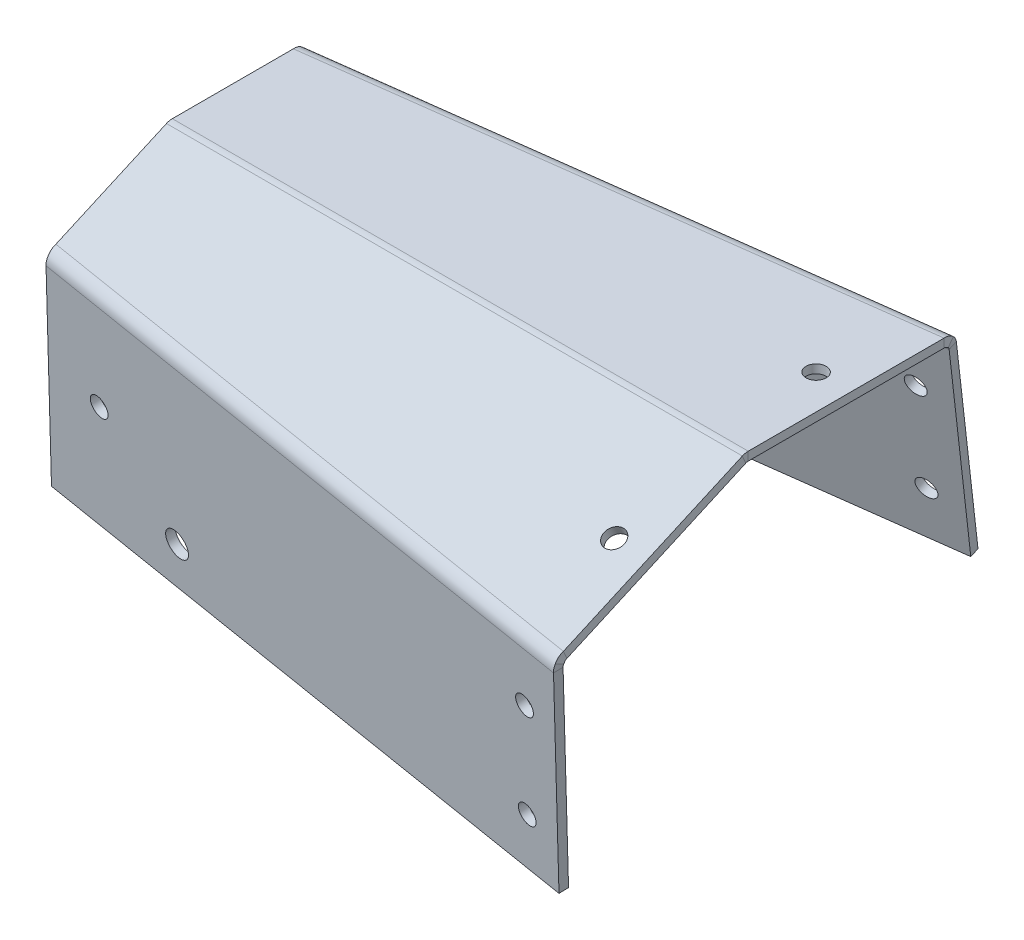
ISO-10303-21;
HEADER;
FILE_DESCRIPTION(('STEP AP214'),'2;1');
FILE_NAME('part.step','',(''),(''),'','','');
FILE_SCHEMA(('AUTOMOTIVE_DESIGN { 1 0 10303 214 1 1 1 1 }'));
ENDSEC;
DATA;
#1=APPLICATION_CONTEXT('core data for automotive mechanical design processes');
#2=APPLICATION_PROTOCOL_DEFINITION('international standard','automotive_design',2000,#1);
#3=PRODUCT_CONTEXT('',#1,'mechanical');
#4=PRODUCT('Part','Part','',(#3));
#5=PRODUCT_RELATED_PRODUCT_CATEGORY('part','',(#4));
#6=PRODUCT_DEFINITION_FORMATION('','',#4);
#7=PRODUCT_DEFINITION_CONTEXT('part definition',#1,'design');
#8=PRODUCT_DEFINITION('design','',#6,#7);
#9=PRODUCT_DEFINITION_SHAPE('','',#8);
#10=(LENGTH_UNIT() NAMED_UNIT(*) SI_UNIT(.MILLI.,.METRE.));
#11=(NAMED_UNIT(*) PLANE_ANGLE_UNIT() SI_UNIT($,.RADIAN.));
#12=(NAMED_UNIT(*) SI_UNIT($,.STERADIAN.) SOLID_ANGLE_UNIT());
#13=UNCERTAINTY_MEASURE_WITH_UNIT(LENGTH_MEASURE(1.E-05),#10,'distance_accuracy_value','');
#14=(GEOMETRIC_REPRESENTATION_CONTEXT(3) GLOBAL_UNCERTAINTY_ASSIGNED_CONTEXT((#13)) GLOBAL_UNIT_ASSIGNED_CONTEXT((#10,
#11,#12)) REPRESENTATION_CONTEXT('',''));
#15=CARTESIAN_POINT('',(0.,0.,0.));
#16=DIRECTION('',(0.,0.,1.));
#17=DIRECTION('',(1.,0.,0.));
#18=AXIS2_PLACEMENT_3D('',#15,#16,#17);
#19=CARTESIAN_POINT('',(90.,30.5027151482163,-68.5102199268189));
#20=DIRECTION('',(0.,0.913545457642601,0.406736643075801));
#21=DIRECTION('',(0.,-0.406736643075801,0.913545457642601));
#22=AXIS2_PLACEMENT_3D('',#19,#20,#21);
#23=PLANE('',#22);
#24=CARTESIAN_POINT('',(94.,-7.32379265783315,16.4495076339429));
#25=DIRECTION('',(0.,0.913545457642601,0.406736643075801));
#26=DIRECTION('',(0.,0.406736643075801,-0.913545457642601));
#27=AXIS2_PLACEMENT_3D('',#24,#25,#26);
#28=CIRCLE('',#27,1.75);
#29=CARTESIAN_POINT('',(94.,-6.6120035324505,14.8508030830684));
#30=VERTEX_POINT('',#29);
#31=EDGE_CURVE('E683',#30,#30,#28,.T.);
#32=ORIENTED_EDGE('',*,*,#31,.T.);
#33=EDGE_LOOP('',(#32));
#34=FACE_BOUND('',#33,.T.);
#35=DIRECTION('',(0.,-0.406736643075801,0.913545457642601));
#36=VECTOR('',#35,1.);
#37=CARTESIAN_POINT('',(0.,8.94567306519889,-20.0923106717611));
#38=LINE('',#37,#36);
#39=CARTESIAN_POINT('',(0.,-0.0864545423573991,0.194180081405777));
#40=VERTEX_POINT('',#39);
#41=CARTESIAN_POINT('',(0.,-8.63601303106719,19.3968028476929));
#42=VERTEX_POINT('',#41);
#43=EDGE_CURVE('E123',#40,#42,#38,.T.);
#44=ORIENTED_EDGE('',*,*,#43,.F.);
#45=DIRECTION('',(1.,0.,0.));
#46=VECTOR('',#45,1.);
#47=CARTESIAN_POINT('',(90.,-0.0864545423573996,0.194180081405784));
#48=LINE('',#47,#46);
#49=CARTESIAN_POINT('',(100.,-0.0864545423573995,0.194180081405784));
#50=VERTEX_POINT('',#49);
#51=EDGE_CURVE('E115',#40,#50,#48,.T.);
#52=ORIENTED_EDGE('',*,*,#51,.T.);
#53=DIRECTION('',(0.,0.406736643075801,-0.913545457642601));
#54=VECTOR('',#53,1.);
#55=CARTESIAN_POINT('',(100.,-14.2383155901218,31.9797804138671));
#56=LINE('',#55,#54);
#57=CARTESIAN_POINT('',(100.,-13.9235893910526,31.2728937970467));
#58=VERTEX_POINT('',#57);
#59=EDGE_CURVE('E130',#58,#50,#56,.T.);
#60=ORIENTED_EDGE('',*,*,#59,.F.);
#61=DIRECTION('',(-0.991655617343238,0.0524345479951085,-0.117769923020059));
#62=VECTOR('',#61,1.);
#63=CARTESIAN_POINT('',(76.2027651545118,-12.6652924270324,28.4467125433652));
#64=LINE('',#63,#62);
#65=EDGE_CURVE('E655',#58,#42,#64,.T.);
#66=ORIENTED_EDGE('',*,*,#65,.T.);
#67=EDGE_LOOP('',(#44,#52,#60,#66));
#68=FACE_BOUND('',#67,.T.);
#69=ADVANCED_FACE('F105',(#34,#68),#23,.F.);
#70=CARTESIAN_POINT('',(0.,10.3159912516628,-19.4822057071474));
#71=DIRECTION('',(1.,0.,0.));
#72=DIRECTION('',(0.,0.406736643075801,-0.913545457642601));
#73=AXIS2_PLACEMENT_3D('',#70,#71,#72);
#74=PLANE('',#73);
#75=DIRECTION('',(0.,-0.406736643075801,0.913545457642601));
#76=VECTOR('',#75,1.);
#77=CARTESIAN_POINT('',(0.,10.3159912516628,-19.4822057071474));
#78=LINE('',#77,#76);
#79=CARTESIAN_POINT('',(0.,1.2838636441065,0.804285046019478));
#80=VERTEX_POINT('',#79);
#81=CARTESIAN_POINT('',(0.,-7.2656948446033,20.0069078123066));
#82=VERTEX_POINT('',#81);
#83=EDGE_CURVE('E262',#80,#82,#78,.T.);
#84=ORIENTED_EDGE('',*,*,#83,.F.);
#85=DIRECTION('',(0.,-0.913545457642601,-0.406736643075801));
#86=VECTOR('',#85,1.);
#87=CARTESIAN_POINT('',(0.,1.2838636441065,0.804285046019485));
#88=LINE('',#87,#86);
#89=EDGE_CURVE('E14',#80,#40,#88,.T.);
#90=ORIENTED_EDGE('',*,*,#89,.T.);
#91=ORIENTED_EDGE('',*,*,#43,.T.);
#92=CARTESIAN_POINT('',(0.,-7.26569484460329,20.0069078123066));
#93=CARTESIAN_POINT('',(0.,-8.63601303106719,19.3968028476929));
#94=B_SPLINE_CURVE_WITH_KNOTS('',1,(#92,#93),.UNSPECIFIED.,.F.,.F.,(2,2),(0.,1.),.UNSPECIFIED.);
#95=EDGE_CURVE('E657',#42,#82,#94,.F.);
#96=ORIENTED_EDGE('',*,*,#95,.T.);
#97=EDGE_LOOP('',(#84,#90,#91,#96));
#98=FACE_BOUND('',#97,.T.);
#99=ADVANCED_FACE('F107',(#98),#74,.F.);
#100=CARTESIAN_POINT('',(100.,-12.8679974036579,32.5898853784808));
#101=DIRECTION('',(-1.,0.,0.));
#102=DIRECTION('',(0.,-0.406736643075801,0.913545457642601));
#103=AXIS2_PLACEMENT_3D('',#100,#101,#102);
#104=PLANE('',#103);
#105=ORIENTED_EDGE('',*,*,#59,.T.);
#106=DIRECTION('',(0.,0.913545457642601,0.406736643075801));
#107=VECTOR('',#106,1.);
#108=CARTESIAN_POINT('',(100.,1.2838636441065,0.804285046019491));
#109=LINE('',#108,#107);
#110=CARTESIAN_POINT('',(99.9999999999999,1.2838636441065,0.804285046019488));
#111=VERTEX_POINT('',#110);
#112=EDGE_CURVE('E244',#50,#111,#109,.T.);
#113=ORIENTED_EDGE('',*,*,#112,.T.);
#114=DIRECTION('',(0.,0.406736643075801,-0.913545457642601));
#115=VECTOR('',#114,1.);
#116=CARTESIAN_POINT('',(100.,-12.8679974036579,32.5898853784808));
#117=LINE('',#116,#115);
#118=CARTESIAN_POINT('',(99.9999999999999,-12.5532712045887,31.8829987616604));
#119=VERTEX_POINT('',#118);
#120=EDGE_CURVE('E247',#119,#111,#117,.T.);
#121=ORIENTED_EDGE('',*,*,#120,.F.);
#122=CARTESIAN_POINT('',(99.9999999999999,-13.9235893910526,31.2728937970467));
#123=CARTESIAN_POINT('',(99.9999999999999,-12.5532712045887,31.8829987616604));
#124=B_SPLINE_CURVE_WITH_KNOTS('',1,(#122,#123),.UNSPECIFIED.,.F.,.F.,(2,2),(0.,1.),.UNSPECIFIED.);
#125=EDGE_CURVE('E272',#119,#58,#124,.F.);
#126=ORIENTED_EDGE('',*,*,#125,.T.);
#127=EDGE_LOOP('',(#105,#113,#121,#126));
#128=FACE_BOUND('',#127,.T.);
#129=ADVANCED_FACE('F246',(#128),#104,.F.);
#130=CARTESIAN_POINT('',(90.,31.8730333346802,-67.9001149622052));
#131=DIRECTION('',(0.,0.913545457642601,0.406736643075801));
#132=DIRECTION('',(0.,-0.406736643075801,0.913545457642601));
#133=AXIS2_PLACEMENT_3D('',#130,#131,#132);
#134=PLANE('',#133);
#135=DIRECTION('',(1.,0.,0.));
#136=VECTOR('',#135,1.);
#137=CARTESIAN_POINT('',(90.,1.2838636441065,0.804285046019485));
#138=LINE('',#137,#136);
#139=EDGE_CURVE('E252',#80,#111,#138,.T.);
#140=ORIENTED_EDGE('',*,*,#139,.F.);
#141=ORIENTED_EDGE('',*,*,#83,.T.);
#142=DIRECTION('',(-0.991655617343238,0.0524345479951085,-0.117769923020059));
#143=VECTOR('',#142,1.);
#144=CARTESIAN_POINT('',(76.2027651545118,-11.2949742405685,29.0568175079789));
#145=LINE('',#144,#143);
#146=EDGE_CURVE('E261',#119,#82,#145,.T.);
#147=ORIENTED_EDGE('',*,*,#146,.F.);
#148=ORIENTED_EDGE('',*,*,#120,.T.);
#149=EDGE_LOOP('',(#140,#141,#147,#148));
#150=FACE_BOUND('',#149,.T.);
#151=CARTESIAN_POINT('',(94.,-5.95347447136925,17.0596125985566));
#152=DIRECTION('',(0.,0.913545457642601,0.406736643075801));
#153=DIRECTION('',(0.,0.406736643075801,-0.913545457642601));
#154=AXIS2_PLACEMENT_3D('',#151,#152,#153);
#155=CIRCLE('',#154,1.75);
#156=CARTESIAN_POINT('',(94.,-5.2416853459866,15.4609080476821));
#157=VERTEX_POINT('',#156);
#158=EDGE_CURVE('E646',#157,#157,#155,.T.);
#159=ORIENTED_EDGE('',*,*,#158,.F.);
#160=EDGE_LOOP('',(#159));
#161=FACE_BOUND('',#160,.T.);
#162=ADVANCED_FACE('F257',(#150,#161),#134,.T.);
#163=CARTESIAN_POINT('',(94.,-5.95347447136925,17.0596125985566));
#164=DIRECTION('',(0.,-0.913545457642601,-0.406736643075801));
#165=DIRECTION('',(0.,0.406736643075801,-0.913545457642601));
#166=AXIS2_PLACEMENT_3D('',#163,#164,#165);
#167=CYLINDRICAL_SURFACE('',#166,1.75);
#168=ORIENTED_EDGE('',*,*,#158,.T.);
#169=EDGE_LOOP('',(#168));
#170=FACE_BOUND('',#169,.T.);
#171=ORIENTED_EDGE('',*,*,#31,.F.);
#172=EDGE_LOOP('',(#171));
#173=FACE_BOUND('',#172,.T.);
#174=ADVANCED_FACE('F710',(#170,#173),#167,.F.);
#175=CARTESIAN_POINT('',(99.725182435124,-15.2219545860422,33.3213033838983));
#176=CARTESIAN_POINT('',(99.7611192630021,-14.7768018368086,33.3954143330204));
#177=CARTESIAN_POINT('',(99.8123762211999,-14.3154770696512,33.3467561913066));
#178=CARTESIAN_POINT('',(99.8751859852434,-13.8984998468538,33.1820449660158));
#179=CARTESIAN_POINT('',(99.9119662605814,-14.9922203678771,31.8508157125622));
#180=CARTESIAN_POINT('',(99.9388495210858,-14.814823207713,31.8819452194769));
#181=CARTESIAN_POINT('',(99.9717941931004,-14.6309462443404,31.8639589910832));
#182=CARTESIAN_POINT('',(100.009426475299,-14.4648191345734,31.7995609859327));
#183=B_SPLINE_SURFACE_WITH_KNOTS('',1,3,((#175,#176,#177,#178),(#179,#180,#181,#182)),
.UNSPECIFIED.,.F.,.F.,.F.,(2,2),(4,4),(0.,1.),(0.,1.),.UNSPECIFIED.);
#184=CARTESIAN_POINT('',(99.725182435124,-15.2219545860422,33.3213033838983));
#185=CARTESIAN_POINT('',(99.9119662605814,-14.9922203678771,31.8508157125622));
#186=B_SPLINE_CURVE_WITH_KNOTS('',1,(#184,#185),.UNSPECIFIED.,.F.,.F.,(2,2),(0.,1.),.UNSPECIFIED.);
#187=CARTESIAN_POINT('',(99.725182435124,-15.2219545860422,33.3213033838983));
#188=VERTEX_POINT('',#187);
#189=CARTESIAN_POINT('',(99.9119662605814,-14.9922203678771,31.8508157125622));
#190=VERTEX_POINT('',#189);
#191=EDGE_CURVE('E634',#188,#190,#186,.T.);
#192=CARTESIAN_POINT('',(99.9119662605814,-14.9922203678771,31.8508157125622));
#193=CARTESIAN_POINT('',(99.9388495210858,-14.814823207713,31.8819452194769));
#194=CARTESIAN_POINT('',(99.9717941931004,-14.6309462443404,31.8639589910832));
#195=CARTESIAN_POINT('',(100.009426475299,-14.4648191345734,31.7995609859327));
#196=B_SPLINE_CURVE_WITH_KNOTS('',3,(#192,#193,#194,#195),.UNSPECIFIED.,.F.,.F.,(4,4),(0.,1.),.UNSPECIFIED.);
#197=CARTESIAN_POINT('',(100.009426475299,-14.4648191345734,31.7995609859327));
#198=VERTEX_POINT('',#197);
#199=EDGE_CURVE('E613',#190,#198,#196,.T.);
#200=CARTESIAN_POINT('',(100.009426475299,-14.4648191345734,31.7995609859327));
#201=CARTESIAN_POINT('',(99.8751859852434,-13.8984998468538,33.1820449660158));
#202=B_SPLINE_CURVE_WITH_KNOTS('',1,(#200,#201),.UNSPECIFIED.,.F.,.F.,(2,2),(0.,1.),.UNSPECIFIED.);
#203=CARTESIAN_POINT('',(99.8751859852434,-13.8984998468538,33.1820449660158));
#204=VERTEX_POINT('',#203);
#205=EDGE_CURVE('E685',#198,#204,#202,.T.);
#206=CARTESIAN_POINT('',(99.8751859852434,-13.8984998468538,33.1820449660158));
#207=CARTESIAN_POINT('',(99.8123762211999,-14.3154770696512,33.3467561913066));
#208=CARTESIAN_POINT('',(99.7611192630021,-14.7768018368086,33.3954143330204));
#209=CARTESIAN_POINT('',(99.725182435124,-15.2219545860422,33.3213033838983));
#210=B_SPLINE_CURVE_WITH_KNOTS('',3,(#206,#207,#208,#209),.UNSPECIFIED.,.F.,.F.,(4,4),(0.,1.),.UNSPECIFIED.);
#211=EDGE_CURVE('E590',#188,#204,#210,.F.);
#212=ORIENTED_EDGE('',*,*,#191,.T.);
#213=ORIENTED_EDGE('',*,*,#199,.T.);
#214=ORIENTED_EDGE('',*,*,#205,.T.);
#215=ORIENTED_EDGE('',*,*,#211,.F.);
#216=EDGE_LOOP('',(#212,#213,#214,#215));
#217=FACE_BOUND('',#216,.T.);
#218=ADVANCED_FACE('F705',(#217),#183,.T.);
#219=CARTESIAN_POINT('',(99.8751859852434,-13.8984998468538,33.1820449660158));
#220=CARTESIAN_POINT('',(99.8883678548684,-13.6020016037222,33.0618677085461));
#221=CARTESIAN_POINT('',(99.9070897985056,-13.3291414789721,32.8845633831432));
#222=CARTESIAN_POINT('',(99.9505559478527,-12.8695830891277,32.4408376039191));
#223=CARTESIAN_POINT('',(99.9752665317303,-12.6831188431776,32.1746413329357));
#224=CARTESIAN_POINT('',(99.9999999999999,-12.5532712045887,31.8829987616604));
#225=CARTESIAN_POINT('',(100.009426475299,-14.4648191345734,31.7995609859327));
#226=CARTESIAN_POINT('',(100.004805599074,-14.3456969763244,31.7503152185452));
#227=CARTESIAN_POINT('',(100.002403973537,-14.2360296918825,31.6782187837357));
#228=CARTESIAN_POINT('',(100.000006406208,-14.0511602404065,31.4983789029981));
#229=CARTESIAN_POINT('',(100.000000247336,-13.9760514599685,31.3907255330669));
#230=CARTESIAN_POINT('',(99.9999999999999,-13.9235893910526,31.2728937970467));
#231=B_SPLINE_SURFACE_WITH_KNOTS('',1,3,((#219,#220,#221,#222,#223,#224),(#225,#226,#227,#228,
#229,#230)),.UNSPECIFIED.,.F.,.F.,.F.,(2,2),(4,2,4),(0.,1.),(0.,0.5,1.),.UNSPECIFIED.);
#232=CARTESIAN_POINT('',(100.009426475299,-14.4648191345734,31.7995609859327));
#233=CARTESIAN_POINT('',(100.004805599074,-14.3456969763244,31.7503152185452));
#234=CARTESIAN_POINT('',(100.002403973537,-14.2360296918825,31.6782187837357));
#235=CARTESIAN_POINT('',(100.000006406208,-14.0511602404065,31.4983789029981));
#236=CARTESIAN_POINT('',(100.000000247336,-13.9760514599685,31.3907255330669));
#237=CARTESIAN_POINT('',(99.9999999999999,-13.9235893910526,31.2728937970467));
#238=B_SPLINE_CURVE_WITH_KNOTS('',3,(#232,#233,#234,#235,#236,#237),.UNSPECIFIED.,.F.,.F.,(4,2,
4),(0.,0.5,1.),.UNSPECIFIED.);
#239=EDGE_CURVE('E609',#198,#58,#238,.T.);
#240=CARTESIAN_POINT('',(99.9999999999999,-12.5532712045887,31.8829987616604));
#241=CARTESIAN_POINT('',(99.9752665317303,-12.6831188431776,32.1746413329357));
#242=CARTESIAN_POINT('',(99.9505559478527,-12.8695830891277,32.4408376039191));
#243=CARTESIAN_POINT('',(99.9070897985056,-13.3291414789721,32.8845633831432));
#244=CARTESIAN_POINT('',(99.8883678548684,-13.6020016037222,33.0618677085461));
#245=CARTESIAN_POINT('',(99.8751859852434,-13.8984998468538,33.1820449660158));
#246=B_SPLINE_CURVE_WITH_KNOTS('',3,(#240,#241,#242,#243,#244,#245),.UNSPECIFIED.,.F.,.F.,(4,2,
4),(0.,0.5,1.),.UNSPECIFIED.);
#247=EDGE_CURVE('E586',#204,#119,#246,.F.);
#248=ORIENTED_EDGE('',*,*,#205,.F.);
#249=ORIENTED_EDGE('',*,*,#239,.T.);
#250=ORIENTED_EDGE('',*,*,#125,.F.);
#251=ORIENTED_EDGE('',*,*,#247,.F.);
#252=EDGE_LOOP('',(#248,#249,#250,#251));
#253=FACE_BOUND('',#252,.T.);
#254=ADVANCED_FACE('F749',(#253),#231,.T.);
#255=CARTESIAN_POINT('',(0.,-7.26569484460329,20.0069078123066));
#256=CARTESIAN_POINT('',(-0.0247334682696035,-7.39554248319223,20.2985503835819));
#257=CARTESIAN_POINT('',(-0.0494440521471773,-7.58200672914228,20.5647466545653));
#258=CARTESIAN_POINT('',(-0.0929102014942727,-8.04156511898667,21.0084724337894));
#259=CARTESIAN_POINT('',(-0.111632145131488,-8.31442524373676,21.1857767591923));
#260=CARTESIAN_POINT('',(-0.124814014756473,-8.61092348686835,21.305954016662));
#261=CARTESIAN_POINT('',(0.,-8.63601303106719,19.3968028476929));
#262=CARTESIAN_POINT('',(2.47336559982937E-07,-8.68847509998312,19.5146345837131));
#263=CARTESIAN_POINT('',(6.40620828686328E-06,-8.76358388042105,19.6222879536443));
#264=CARTESIAN_POINT('',(0.00240397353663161,-8.94845333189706,19.8021278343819));
#265=CARTESIAN_POINT('',(0.00480559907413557,-9.05812061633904,19.8742242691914));
#266=CARTESIAN_POINT('',(0.00942647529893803,-9.17724277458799,19.9234700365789));
#267=B_SPLINE_SURFACE_WITH_KNOTS('',1,3,((#255,#256,#257,#258,#259,#260),(#261,#262,#263,#264,
#265,#266)),.UNSPECIFIED.,.F.,.F.,.F.,(2,2),(4,2,4),(0.,1.),(0.,0.5,1.),.UNSPECIFIED.);
#268=CARTESIAN_POINT('',(0.,-8.63601303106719,19.3968028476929));
#269=CARTESIAN_POINT('',(2.47336559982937E-07,-8.68847509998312,19.5146345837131));
#270=CARTESIAN_POINT('',(6.40620828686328E-06,-8.76358388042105,19.6222879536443));
#271=CARTESIAN_POINT('',(0.00240397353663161,-8.94845333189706,19.8021278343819));
#272=CARTESIAN_POINT('',(0.00480559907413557,-9.05812061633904,19.8742242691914));
#273=CARTESIAN_POINT('',(0.00942647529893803,-9.17724277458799,19.9234700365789));
#274=B_SPLINE_CURVE_WITH_KNOTS('',3,(#268,#269,#270,#271,#272,#273),.UNSPECIFIED.,.F.,.F.,(4,2,
4),(0.,0.5,1.),.UNSPECIFIED.);
#275=CARTESIAN_POINT('',(0.00942647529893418,-9.17724277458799,19.9234700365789));
#276=VERTEX_POINT('',#275);
#277=EDGE_CURVE('E603',#42,#276,#274,.T.);
#278=CARTESIAN_POINT('',(0.00942647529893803,-9.17724277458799,19.9234700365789));
#279=CARTESIAN_POINT('',(-0.124814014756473,-8.61092348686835,21.305954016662));
#280=B_SPLINE_CURVE_WITH_KNOTS('',1,(#278,#279),.UNSPECIFIED.,.F.,.F.,(2,2),(0.,1.),.UNSPECIFIED.);
#281=CARTESIAN_POINT('',(-0.124814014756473,-8.61092348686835,21.305954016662));
#282=VERTEX_POINT('',#281);
#283=EDGE_CURVE('E688',#276,#282,#280,.T.);
#284=CARTESIAN_POINT('',(-0.124814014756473,-8.61092348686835,21.305954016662));
#285=CARTESIAN_POINT('',(-0.111632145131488,-8.31442524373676,21.1857767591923));
#286=CARTESIAN_POINT('',(-0.0929102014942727,-8.04156511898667,21.0084724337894));
#287=CARTESIAN_POINT('',(-0.0494440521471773,-7.58200672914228,20.5647466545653));
#288=CARTESIAN_POINT('',(-0.0247334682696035,-7.39554248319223,20.2985503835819));
#289=CARTESIAN_POINT('',(0.,-7.26569484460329,20.0069078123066));
#290=B_SPLINE_CURVE_WITH_KNOTS('',3,(#284,#285,#286,#287,#288,#289),.UNSPECIFIED.,.F.,.F.,(4,2,
4),(0.,0.5,1.),.UNSPECIFIED.);
#291=EDGE_CURVE('E594',#82,#282,#290,.F.);
#292=ORIENTED_EDGE('',*,*,#95,.F.);
#293=ORIENTED_EDGE('',*,*,#277,.T.);
#294=ORIENTED_EDGE('',*,*,#283,.T.);
#295=ORIENTED_EDGE('',*,*,#291,.F.);
#296=EDGE_LOOP('',(#292,#293,#294,#295));
#297=FACE_BOUND('',#296,.T.);
#298=ADVANCED_FACE('F557',(#297),#267,.T.);
#299=CARTESIAN_POINT('',(-0.124814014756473,-8.61092348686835,21.305954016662));
#300=CARTESIAN_POINT('',(-0.187623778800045,-9.02790070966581,21.4706652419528));
#301=CARTESIAN_POINT('',(-0.238880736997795,-9.48922547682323,21.5193233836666));
#302=CARTESIAN_POINT('',(-0.274817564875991,-9.93437822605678,21.4452124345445));
#303=CARTESIAN_POINT('',(0.00942647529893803,-9.17724277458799,19.9234700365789));
#304=CARTESIAN_POINT('',(-0.0282058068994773,-9.34336988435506,19.9878680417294));
#305=CARTESIAN_POINT('',(-0.0611504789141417,-9.52724684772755,20.005854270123));
#306=CARTESIAN_POINT('',(-0.0880337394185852,-9.70464400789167,19.9747247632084));
#307=B_SPLINE_SURFACE_WITH_KNOTS('',1,3,((#299,#300,#301,#302),(#303,#304,#305,#306)),
.UNSPECIFIED.,.F.,.F.,.F.,(2,2),(4,4),(0.,1.),(0.,1.),.UNSPECIFIED.);
#308=CARTESIAN_POINT('',(0.00942647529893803,-9.17724277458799,19.9234700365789));
#309=CARTESIAN_POINT('',(-0.0282058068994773,-9.34336988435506,19.9878680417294));
#310=CARTESIAN_POINT('',(-0.0611504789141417,-9.52724684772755,20.005854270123));
#311=CARTESIAN_POINT('',(-0.0880337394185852,-9.70464400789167,19.9747247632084));
#312=B_SPLINE_CURVE_WITH_KNOTS('',3,(#308,#309,#310,#311),.UNSPECIFIED.,.F.,.F.,(4,4),(0.,1.),.UNSPECIFIED.);
#313=CARTESIAN_POINT('',(-0.0880337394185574,-9.70464400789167,19.9747247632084));
#314=VERTEX_POINT('',#313);
#315=EDGE_CURVE('E599',#276,#314,#312,.T.);
#316=CARTESIAN_POINT('',(-0.0880337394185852,-9.70464400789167,19.9747247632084));
#317=CARTESIAN_POINT('',(-0.274817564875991,-9.93437822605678,21.4452124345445));
#318=B_SPLINE_CURVE_WITH_KNOTS('',1,(#316,#317),.UNSPECIFIED.,.F.,.F.,(2,2),(0.,1.),.UNSPECIFIED.);
#319=CARTESIAN_POINT('',(-0.274817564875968,-9.93437822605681,21.4452124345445));
#320=VERTEX_POINT('',#319);
#321=EDGE_CURVE('E537',#314,#320,#318,.T.);
#322=CARTESIAN_POINT('',(-0.274817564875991,-9.93437822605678,21.4452124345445));
#323=CARTESIAN_POINT('',(-0.238880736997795,-9.48922547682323,21.5193233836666));
#324=CARTESIAN_POINT('',(-0.187623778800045,-9.02790070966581,21.4706652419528));
#325=CARTESIAN_POINT('',(-0.124814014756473,-8.61092348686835,21.305954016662));
#326=B_SPLINE_CURVE_WITH_KNOTS('',3,(#322,#323,#324,#325),.UNSPECIFIED.,.F.,.F.,(4,4),(0.,1.),.UNSPECIFIED.);
#327=EDGE_CURVE('E598',#282,#320,#326,.F.);
#328=ORIENTED_EDGE('',*,*,#315,.T.);
#329=ORIENTED_EDGE('',*,*,#321,.T.);
#330=ORIENTED_EDGE('',*,*,#327,.F.);
#331=ORIENTED_EDGE('',*,*,#283,.F.);
#332=EDGE_LOOP('',(#328,#329,#330,#331));
#333=FACE_BOUND('',#332,.T.);
#334=ADVANCED_FACE('F555',(#333),#307,.T.);
#335=CARTESIAN_POINT('',(-50.3156161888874,-6.88908186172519,13.014537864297));
#336=DIRECTION('',(0.991655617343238,-0.0524345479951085,0.117769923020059));
#337=DIRECTION('',(0.128915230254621,0.40334267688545,-0.905922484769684));
#338=AXIS2_PLACEMENT_3D('',#335,#336,#337);
#339=CYLINDRICAL_SURFACE('',#338,2.5);
#340=ORIENTED_EDGE('',*,*,#291,.T.);
#341=ORIENTED_EDGE('',*,*,#327,.T.);
#342=DIRECTION('',(-0.991655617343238,0.0524345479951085,-0.117769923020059));
#343=VECTOR('',#342,1.);
#344=CARTESIAN_POINT('',(75.8914587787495,-13.9617282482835,30.4907886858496));
#345=LINE('',#344,#343);
#346=EDGE_CURVE('E874',#188,#320,#345,.T.);
#347=ORIENTED_EDGE('',*,*,#346,.F.);
#348=ORIENTED_EDGE('',*,*,#211,.T.);
#349=ORIENTED_EDGE('',*,*,#247,.T.);
#350=ORIENTED_EDGE('',*,*,#146,.T.);
#351=EDGE_LOOP('',(#340,#341,#347,#348,#349,#350));
#352=FACE_BOUND('',#351,.T.);
#353=ADVANCED_FACE('F544',(#352),#339,.T.);
#354=CARTESIAN_POINT('',(-50.3156161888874,-6.88908186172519,13.014537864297));
#355=DIRECTION('',(0.991655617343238,-0.0524345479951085,0.117769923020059));
#356=DIRECTION('',(0.128915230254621,0.40334267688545,-0.905922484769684));
#357=AXIS2_PLACEMENT_3D('',#354,#355,#356);
#358=CYLINDRICAL_SURFACE('',#357,1.);
#359=ORIENTED_EDGE('',*,*,#277,.F.);
#360=ORIENTED_EDGE('',*,*,#65,.F.);
#361=ORIENTED_EDGE('',*,*,#239,.F.);
#362=ORIENTED_EDGE('',*,*,#199,.F.);
#363=DIRECTION('',(-0.991655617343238,0.0524345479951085,-0.117769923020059));
#364=VECTOR('',#363,1.);
#365=CARTESIAN_POINT('',(76.0782426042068,-13.7319940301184,29.0203010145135));
#366=LINE('',#365,#364);
#367=EDGE_CURVE('E809',#190,#314,#366,.T.);
#368=ORIENTED_EDGE('',*,*,#367,.T.);
#369=ORIENTED_EDGE('',*,*,#315,.F.);
#370=EDGE_LOOP('',(#359,#360,#361,#362,#368,#369));
#371=FACE_BOUND('',#370,.T.);
#372=ADVANCED_FACE('F554',(#371),#358,.F.);
#373=CARTESIAN_POINT('',(93.718953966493,-54.8562975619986,26.3663106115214));
#374=DIRECTION('',(0.0333657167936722,0.98680991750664,0.158407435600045));
#375=DIRECTION('',(-0.991655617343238,0.0524345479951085,-0.117769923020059));
#376=AXIS2_PLACEMENT_3D('',#373,#374,#375);
#377=PLANE('',#376);
#378=DIRECTION('',(0.991655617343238,-0.0524345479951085,0.117769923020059));
#379=VECTOR('',#378,1.);
#380=CARTESIAN_POINT('',(93.9057377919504,-54.6265633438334,24.8958229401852));
#381=LINE('',#380,#379);
#382=CARTESIAN_POINT('',(-6.09426220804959,-49.338986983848,13.0197319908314));
#383=VERTEX_POINT('',#382);
#384=CARTESIAN_POINT('',(93.9057377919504,-54.6265633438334,24.8958229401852));
#385=VERTEX_POINT('',#384);
#386=EDGE_CURVE('E535',#383,#385,#381,.T.);
#387=ORIENTED_EDGE('',*,*,#386,.T.);
#388=DIRECTION('',(0.12452255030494,0.153156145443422,-0.980325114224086));
#389=VECTOR('',#388,1.);
#390=CARTESIAN_POINT('',(93.718953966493,-54.8562975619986,26.3663106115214));
#391=LINE('',#390,#389);
#392=CARTESIAN_POINT('',(93.718953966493,-54.8562975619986,26.3663106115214));
#393=VERTEX_POINT('',#392);
#394=EDGE_CURVE('E499',#393,#385,#391,.T.);
#395=ORIENTED_EDGE('',*,*,#394,.F.);
#396=DIRECTION('',(0.991655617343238,-0.0524345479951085,0.117769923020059));
#397=VECTOR('',#396,1.);
#398=CARTESIAN_POINT('',(93.718953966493,-54.8562975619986,26.3663106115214));
#399=LINE('',#398,#397);
#400=CARTESIAN_POINT('',(-6.281046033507,-49.5687212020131,14.4902196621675));
#401=VERTEX_POINT('',#400);
#402=EDGE_CURVE('E516',#401,#393,#399,.T.);
#403=ORIENTED_EDGE('',*,*,#402,.F.);
#404=DIRECTION('',(0.12452255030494,0.153156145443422,-0.980325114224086));
#405=VECTOR('',#404,1.);
#406=CARTESIAN_POINT('',(-6.281046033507,-49.5687212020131,14.4902196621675));
#407=LINE('',#406,#405);
#408=EDGE_CURVE('E532',#401,#383,#407,.T.);
#409=ORIENTED_EDGE('',*,*,#408,.T.);
#410=EDGE_LOOP('',(#387,#395,#403,#409));
#411=FACE_BOUND('',#410,.T.);
#412=ADVANCED_FACE('F937',(#411),#377,.F.);
#413=CARTESIAN_POINT('',(89.2151567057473,-44.7324142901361,27.3758844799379));
#414=DIRECTION('',(0.12452255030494,0.153156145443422,-0.980325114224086));
#415=DIRECTION('',(-0.0947522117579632,0.985335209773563,0.141903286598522));
#416=AXIS2_PLACEMENT_3D('',#413,#414,#415);
#417=CYLINDRICAL_SURFACE('',#416,1.75);
#418=CARTESIAN_POINT('',(89.2151567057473,-44.7324142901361,27.3758844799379));
#419=DIRECTION('',(-0.12452255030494,-0.153156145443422,0.980325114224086));
#420=DIRECTION('',(-0.0947522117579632,0.985335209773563,0.141903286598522));
#421=AXIS2_PLACEMENT_3D('',#418,#419,#420);
#422=CIRCLE('',#421,1.75);
#423=CARTESIAN_POINT('',(89.0493403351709,-43.0080776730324,27.6242152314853));
#424=VERTEX_POINT('',#423);
#425=EDGE_CURVE('E529',#424,#424,#422,.T.);
#426=ORIENTED_EDGE('',*,*,#425,.T.);
#427=EDGE_LOOP('',(#426));
#428=FACE_BOUND('',#427,.T.);
#429=CARTESIAN_POINT('',(89.4019405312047,-44.5026800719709,25.9053968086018));
#430=DIRECTION('',(-0.12452255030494,-0.153156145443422,0.980325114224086));
#431=DIRECTION('',(-0.0947522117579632,0.985335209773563,0.141903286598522));
#432=AXIS2_PLACEMENT_3D('',#429,#430,#431);
#433=CIRCLE('',#432,1.75);
#434=CARTESIAN_POINT('',(89.2361241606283,-42.7783434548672,26.1537275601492));
#435=VERTEX_POINT('',#434);
#436=EDGE_CURVE('E512',#435,#435,#433,.T.);
#437=ORIENTED_EDGE('',*,*,#436,.F.);
#438=EDGE_LOOP('',(#437));
#439=FACE_BOUND('',#438,.T.);
#440=ADVANCED_FACE('F933',(#428,#439),#417,.F.);
#441=CARTESIAN_POINT('',(6.97187130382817,-28.5208479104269,19.4619358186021));
#442=DIRECTION('',(0.12452255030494,0.153156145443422,-0.980325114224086));
#443=DIRECTION('',(-0.0947522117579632,0.985335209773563,0.141903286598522));
#444=AXIS2_PLACEMENT_3D('',#441,#442,#443);
#445=CYLINDRICAL_SURFACE('',#444,1.75);
#446=CARTESIAN_POINT('',(6.97187130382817,-28.5208479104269,19.4619358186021));
#447=DIRECTION('',(-0.12452255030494,-0.153156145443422,0.980325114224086));
#448=DIRECTION('',(-0.0947522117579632,0.985335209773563,0.141903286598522));
#449=AXIS2_PLACEMENT_3D('',#446,#447,#448);
#450=CIRCLE('',#449,1.75);
#451=CARTESIAN_POINT('',(6.80605493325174,-26.7965112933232,19.7102665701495));
#452=VERTEX_POINT('',#451);
#453=EDGE_CURVE('E526',#452,#452,#450,.T.);
#454=ORIENTED_EDGE('',*,*,#453,.T.);
#455=EDGE_LOOP('',(#454));
#456=FACE_BOUND('',#455,.T.);
#457=CARTESIAN_POINT('',(7.15865512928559,-28.2911136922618,17.991448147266));
#458=DIRECTION('',(-0.12452255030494,-0.153156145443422,0.980325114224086));
#459=DIRECTION('',(-0.0947522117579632,0.985335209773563,0.141903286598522));
#460=AXIS2_PLACEMENT_3D('',#457,#458,#459);
#461=CIRCLE('',#460,1.75);
#462=CARTESIAN_POINT('',(6.99283875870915,-26.566777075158,18.2397788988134));
#463=VERTEX_POINT('',#462);
#464=EDGE_CURVE('E509',#463,#463,#461,.T.);
#465=ORIENTED_EDGE('',*,*,#464,.F.);
#466=EDGE_LOOP('',(#465));
#467=FACE_BOUND('',#466,.T.);
#468=ADVANCED_FACE('F927',(#456,#467),#445,.F.);
#469=CARTESIAN_POINT('',(19.8661698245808,-43.0426819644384,18.8310459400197));
#470=DIRECTION('',(0.12452255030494,0.153156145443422,-0.980325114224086));
#471=DIRECTION('',(-0.0947522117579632,0.985335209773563,0.141903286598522));
#472=AXIS2_PLACEMENT_3D('',#469,#470,#471);
#473=CYLINDRICAL_SURFACE('',#472,2.25);
#474=CARTESIAN_POINT('',(19.8661698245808,-43.0426819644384,18.8310459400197));
#475=DIRECTION('',(-0.12452255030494,-0.153156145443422,0.980325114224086));
#476=DIRECTION('',(-0.0947522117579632,0.985335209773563,0.141903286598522));
#477=AXIS2_PLACEMENT_3D('',#474,#475,#476);
#478=CIRCLE('',#477,2.25);
#479=CARTESIAN_POINT('',(19.6529773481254,-40.8256777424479,19.1503283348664));
#480=VERTEX_POINT('',#479);
#481=EDGE_CURVE('E523',#480,#480,#478,.T.);
#482=ORIENTED_EDGE('',*,*,#481,.T.);
#483=EDGE_LOOP('',(#482));
#484=FACE_BOUND('',#483,.T.);
#485=CARTESIAN_POINT('',(20.0529536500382,-42.8129477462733,17.3605582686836));
#486=DIRECTION('',(-0.12452255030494,-0.153156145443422,0.980325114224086));
#487=DIRECTION('',(-0.0947522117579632,0.985335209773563,0.141903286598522));
#488=AXIS2_PLACEMENT_3D('',#485,#486,#487);
#489=CIRCLE('',#488,2.25);
#490=CARTESIAN_POINT('',(19.8397611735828,-40.5959435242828,17.6798406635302));
#491=VERTEX_POINT('',#490);
#492=EDGE_CURVE('E506',#491,#491,#489,.T.);
#493=ORIENTED_EDGE('',*,*,#492,.F.);
#494=EDGE_LOOP('',(#493));
#495=FACE_BOUND('',#494,.T.);
#496=ADVANCED_FACE('F920',(#484,#495),#473,.F.);
#497=CARTESIAN_POINT('',(92.1875301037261,-25.1180976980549,30.8177841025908));
#498=DIRECTION('',(0.12452255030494,0.153156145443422,-0.980325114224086));
#499=DIRECTION('',(-0.0947522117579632,0.985335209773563,0.141903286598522));
#500=AXIS2_PLACEMENT_3D('',#497,#498,#499);
#501=CYLINDRICAL_SURFACE('',#500,1.75);
#502=CARTESIAN_POINT('',(92.1875301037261,-25.1180976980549,30.8177841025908));
#503=DIRECTION('',(-0.12452255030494,-0.153156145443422,0.980325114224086));
#504=DIRECTION('',(-0.0947522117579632,0.985335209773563,0.141903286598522));
#505=AXIS2_PLACEMENT_3D('',#502,#503,#504);
#506=CIRCLE('',#505,1.75);
#507=CARTESIAN_POINT('',(92.0217137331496,-23.3937610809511,31.0661148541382));
#508=VERTEX_POINT('',#507);
#509=EDGE_CURVE('E519',#508,#508,#506,.T.);
#510=ORIENTED_EDGE('',*,*,#509,.T.);
#511=EDGE_LOOP('',(#510));
#512=FACE_BOUND('',#511,.T.);
#513=CARTESIAN_POINT('',(92.3743139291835,-24.8883634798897,29.3472964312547));
#514=DIRECTION('',(-0.12452255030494,-0.153156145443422,0.980325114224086));
#515=DIRECTION('',(-0.0947522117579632,0.985335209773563,0.141903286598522));
#516=AXIS2_PLACEMENT_3D('',#513,#514,#515);
#517=CIRCLE('',#516,1.75);
#518=CARTESIAN_POINT('',(92.2084975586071,-23.164026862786,29.5956271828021));
#519=VERTEX_POINT('',#518);
#520=EDGE_CURVE('E503',#519,#519,#517,.T.);
#521=ORIENTED_EDGE('',*,*,#520,.F.);
#522=EDGE_LOOP('',(#521));
#523=FACE_BOUND('',#522,.T.);
#524=ADVANCED_FACE('F918',(#512,#523),#501,.F.);
#525=CARTESIAN_POINT('',(79.5061222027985,92.943983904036,47.6518036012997));
#526=DIRECTION('',(-0.12452255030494,-0.153156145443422,0.980325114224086));
#527=DIRECTION('',(0.0947522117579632,-0.985335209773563,-0.141903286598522));
#528=AXIS2_PLACEMENT_3D('',#525,#526,#527);
#529=PLANE('',#528);
#530=ORIENTED_EDGE('',*,*,#509,.F.);
#531=EDGE_LOOP('',(#530));
#532=FACE_BOUND('',#531,.T.);
#533=ORIENTED_EDGE('',*,*,#481,.F.);
#534=EDGE_LOOP('',(#533));
#535=FACE_BOUND('',#534,.T.);
#536=ORIENTED_EDGE('',*,*,#453,.F.);
#537=EDGE_LOOP('',(#536));
#538=FACE_BOUND('',#537,.T.);
#539=ORIENTED_EDGE('',*,*,#425,.F.);
#540=EDGE_LOOP('',(#539));
#541=FACE_BOUND('',#540,.T.);
#542=DIRECTION('',(0.147624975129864,0.974158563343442,0.170944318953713));
#543=VECTOR('',#542,1.);
#544=CARTESIAN_POINT('',(99.8056876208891,-14.6907110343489,33.4145254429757));
#545=LINE('',#544,#543);
#546=EDGE_CURVE('E522',#393,#188,#545,.T.);
#547=ORIENTED_EDGE('',*,*,#546,.T.);
#548=ORIENTED_EDGE('',*,*,#346,.T.);
#549=DIRECTION('',(-0.147624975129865,-0.974158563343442,-0.170944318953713));
#550=VECTOR('',#549,1.);
#551=CARTESIAN_POINT('',(-6.281046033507,-49.5687212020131,14.4902196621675));
#552=LINE('',#551,#550);
#553=EDGE_CURVE('E518',#320,#401,#552,.T.);
#554=ORIENTED_EDGE('',*,*,#553,.T.);
#555=ORIENTED_EDGE('',*,*,#402,.T.);
#556=EDGE_LOOP('',(#547,#548,#554,#555));
#557=FACE_BOUND('',#556,.T.);
#558=ADVANCED_FACE('F902',(#532,#535,#538,#541,#557),#529,.T.);
#559=CARTESIAN_POINT('',(-6.281046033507,-49.5687212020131,14.4902196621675));
#560=DIRECTION('',(0.981173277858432,-0.16600689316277,0.098695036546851));
#561=DIRECTION('',(0.147624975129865,0.974158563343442,0.170944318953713));
#562=AXIS2_PLACEMENT_3D('',#559,#560,#561);
#563=PLANE('',#562);
#564=ORIENTED_EDGE('',*,*,#321,.F.);
#565=DIRECTION('',(-0.147624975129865,-0.974158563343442,-0.170944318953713));
#566=VECTOR('',#565,1.);
#567=CARTESIAN_POINT('',(-6.09426220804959,-49.338986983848,13.0197319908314));
#568=LINE('',#567,#566);
#569=EDGE_CURVE('E515',#314,#383,#568,.T.);
#570=ORIENTED_EDGE('',*,*,#569,.T.);
#571=ORIENTED_EDGE('',*,*,#408,.F.);
#572=ORIENTED_EDGE('',*,*,#553,.F.);
#573=EDGE_LOOP('',(#564,#570,#571,#572));
#574=FACE_BOUND('',#573,.T.);
#575=ADVANCED_FACE('F892',(#574),#563,.F.);
#576=CARTESIAN_POINT('',(79.6929060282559,93.1737181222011,46.1813159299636));
#577=DIRECTION('',(-0.12452255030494,-0.153156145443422,0.980325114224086));
#578=DIRECTION('',(0.0947522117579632,-0.985335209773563,-0.141903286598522));
#579=AXIS2_PLACEMENT_3D('',#576,#577,#578);
#580=PLANE('',#579);
#581=ORIENTED_EDGE('',*,*,#367,.F.);
#582=DIRECTION('',(0.147624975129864,0.974158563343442,0.170944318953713));
#583=VECTOR('',#582,1.);
#584=CARTESIAN_POINT('',(99.9924714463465,-14.4609768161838,31.9440377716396));
#585=LINE('',#584,#583);
#586=EDGE_CURVE('E502',#385,#190,#585,.T.);
#587=ORIENTED_EDGE('',*,*,#586,.F.);
#588=ORIENTED_EDGE('',*,*,#386,.F.);
#589=ORIENTED_EDGE('',*,*,#569,.F.);
#590=EDGE_LOOP('',(#581,#587,#588,#589));
#591=FACE_BOUND('',#590,.T.);
#592=ORIENTED_EDGE('',*,*,#436,.T.);
#593=EDGE_LOOP('',(#592));
#594=FACE_BOUND('',#593,.T.);
#595=ORIENTED_EDGE('',*,*,#464,.T.);
#596=EDGE_LOOP('',(#595));
#597=FACE_BOUND('',#596,.T.);
#598=ORIENTED_EDGE('',*,*,#492,.T.);
#599=EDGE_LOOP('',(#598));
#600=FACE_BOUND('',#599,.T.);
#601=ORIENTED_EDGE('',*,*,#520,.T.);
#602=EDGE_LOOP('',(#601));
#603=FACE_BOUND('',#602,.T.);
#604=ADVANCED_FACE('F901',(#591,#594,#597,#600,#603),#580,.F.);
#605=CARTESIAN_POINT('',(99.8056876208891,-14.6907110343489,33.4145254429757));
#606=DIRECTION('',(-0.981173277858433,0.166006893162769,-0.0986950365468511));
#607=DIRECTION('',(-0.147624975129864,-0.974158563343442,-0.170944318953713));
#608=AXIS2_PLACEMENT_3D('',#605,#606,#607);
#609=PLANE('',#608);
#610=ORIENTED_EDGE('',*,*,#191,.F.);
#611=ORIENTED_EDGE('',*,*,#546,.F.);
#612=ORIENTED_EDGE('',*,*,#394,.T.);
#613=ORIENTED_EDGE('',*,*,#586,.T.);
#614=EDGE_LOOP('',(#610,#611,#612,#613));
#615=FACE_BOUND('',#614,.T.);
#616=ADVANCED_FACE('F558',(#615),#609,.F.);
#617=CARTESIAN_POINT('',(93.718953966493,-39.3895767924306,-46.3926617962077));
#618=DIRECTION('',(0.0333657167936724,0.965925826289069,0.256659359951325));
#619=DIRECTION('',(0.991655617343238,0.,-0.128915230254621));
#620=AXIS2_PLACEMENT_3D('',#617,#618,#619);
#621=PLANE('',#620);
#622=DIRECTION('',(-0.991655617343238,0.,0.128915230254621));
#623=VECTOR('',#622,1.);
#624=CARTESIAN_POINT('',(93.9057377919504,-39.7778053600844,-44.955863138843));
#625=LINE('',#624,#623);
#626=CARTESIAN_POINT('',(93.9057377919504,-39.7778053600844,-44.955863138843));
#627=VERTEX_POINT('',#626);
#628=CARTESIAN_POINT('',(-6.09426220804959,-39.7778053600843,-31.955863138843));
#629=VERTEX_POINT('',#628);
#630=EDGE_CURVE('E494',#627,#629,#625,.T.);
#631=ORIENTED_EDGE('',*,*,#630,.T.);
#632=DIRECTION('',(0.12452255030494,-0.258819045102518,0.957865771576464));
#633=VECTOR('',#632,1.);
#634=CARTESIAN_POINT('',(-6.281046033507,-39.3895767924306,-33.3926617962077));
#635=LINE('',#634,#633);
#636=CARTESIAN_POINT('',(-6.281046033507,-39.3895767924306,-33.3926617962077));
#637=VERTEX_POINT('',#636);
#638=EDGE_CURVE('E486',#637,#629,#635,.T.);
#639=ORIENTED_EDGE('',*,*,#638,.F.);
#640=DIRECTION('',(-0.991655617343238,0.,0.128915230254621));
#641=VECTOR('',#640,1.);
#642=CARTESIAN_POINT('',(93.718953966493,-39.3895767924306,-46.3926617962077));
#643=LINE('',#642,#641);
#644=CARTESIAN_POINT('',(93.718953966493,-39.3895767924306,-46.3926617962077));
#645=VERTEX_POINT('',#644);
#646=EDGE_CURVE('E441',#645,#637,#643,.T.);
#647=ORIENTED_EDGE('',*,*,#646,.F.);
#648=DIRECTION('',(0.12452255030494,-0.258819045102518,0.957865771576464));
#649=VECTOR('',#648,1.);
#650=CARTESIAN_POINT('',(93.718953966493,-39.3895767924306,-46.3926617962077));
#651=LINE('',#650,#649);
#652=EDGE_CURVE('E491',#645,#627,#651,.T.);
#653=ORIENTED_EDGE('',*,*,#652,.T.);
#654=EDGE_LOOP('',(#631,#639,#647,#653));
#655=FACE_BOUND('',#654,.T.);
#656=ADVANCED_FACE('F313',(#655),#621,.F.);
#657=CARTESIAN_POINT('',(-6.281046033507,-39.3895767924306,-33.3926617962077));
#658=DIRECTION('',(0.981173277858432,-0.1115119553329,-0.157683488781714));
#659=DIRECTION('',(-0.147624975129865,-0.959467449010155,-0.240060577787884));
#660=AXIS2_PLACEMENT_3D('',#657,#658,#659);
#661=PLANE('',#660);
#662=CARTESIAN_POINT('',(-0.274817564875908,-0.352952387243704,-23.6256242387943));
#663=CARTESIAN_POINT('',(-0.0880337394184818,-0.741180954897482,-22.1888255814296));
#664=B_SPLINE_CURVE_WITH_KNOTS('',1,(#662,#663),.UNSPECIFIED.,.F.,.F.,(2,2),(0.,1.),.UNSPECIFIED.);
#665=CARTESIAN_POINT('',(-0.274817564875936,-0.352952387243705,-23.6256242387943));
#666=VERTEX_POINT('',#665);
#667=CARTESIAN_POINT('',(-0.0880337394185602,-0.741180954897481,-22.1888255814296));
#668=VERTEX_POINT('',#667);
#669=EDGE_CURVE('E294',#666,#668,#664,.T.);
#670=ORIENTED_EDGE('',*,*,#669,.F.);
#671=DIRECTION('',(0.147624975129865,0.959467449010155,0.240060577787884));
#672=VECTOR('',#671,1.);
#673=CARTESIAN_POINT('',(-6.281046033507,-39.3895767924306,-33.3926617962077));
#674=LINE('',#673,#672);
#675=EDGE_CURVE('E450',#637,#666,#674,.T.);
#676=ORIENTED_EDGE('',*,*,#675,.F.);
#677=ORIENTED_EDGE('',*,*,#638,.T.);
#678=DIRECTION('',(0.147624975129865,0.959467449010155,0.240060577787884));
#679=VECTOR('',#678,1.);
#680=CARTESIAN_POINT('',(-6.09426220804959,-39.7778053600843,-31.955863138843));
#681=LINE('',#680,#679);
#682=EDGE_CURVE('E484',#629,#668,#681,.T.);
#683=ORIENTED_EDGE('',*,*,#682,.T.);
#684=EDGE_LOOP('',(#670,#676,#677,#683));
#685=FACE_BOUND('',#684,.T.);
#686=ADVANCED_FACE('F302',(#685),#661,.F.);
#687=CARTESIAN_POINT('',(92.1875301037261,-10.4118020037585,-38.3636696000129));
#688=DIRECTION('',(0.12452255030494,-0.258819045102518,0.957865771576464));
#689=DIRECTION('',(0.0947522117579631,-0.957865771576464,-0.271136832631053));
#690=AXIS2_PLACEMENT_3D('',#687,#688,#689);
#691=CYLINDRICAL_SURFACE('',#690,1.75);
#692=CARTESIAN_POINT('',(92.1875301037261,-10.4118020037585,-38.3636696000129));
#693=DIRECTION('',(-0.12452255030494,0.258819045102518,-0.957865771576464));
#694=DIRECTION('',(-0.0947522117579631,0.957865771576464,0.271136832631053));
#695=AXIS2_PLACEMENT_3D('',#692,#693,#694);
#696=CIRCLE('',#695,1.75);
#697=CARTESIAN_POINT('',(92.0217137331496,-8.73553690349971,-37.8891801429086));
#698=VERTEX_POINT('',#697);
#699=EDGE_CURVE('E481',#698,#698,#696,.T.);
#700=ORIENTED_EDGE('',*,*,#699,.T.);
#701=EDGE_LOOP('',(#700));
#702=FACE_BOUND('',#701,.T.);
#703=CARTESIAN_POINT('',(92.3743139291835,-10.8000305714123,-36.9268709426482));
#704=DIRECTION('',(-0.12452255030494,0.258819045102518,-0.957865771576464));
#705=DIRECTION('',(-0.0947522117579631,0.957865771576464,0.271136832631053));
#706=AXIS2_PLACEMENT_3D('',#703,#704,#705);
#707=CIRCLE('',#706,1.75);
#708=CARTESIAN_POINT('',(92.208497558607,-9.12376547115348,-36.4523814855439));
#709=VERTEX_POINT('',#708);
#710=EDGE_CURVE('E456',#709,#709,#707,.T.);
#711=ORIENTED_EDGE('',*,*,#710,.F.);
#712=EDGE_LOOP('',(#711));
#713=FACE_BOUND('',#712,.T.);
#714=ADVANCED_FACE('F312',(#702,#713),#691,.F.);
#715=CARTESIAN_POINT('',(6.97187130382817,-18.139208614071,-29.3736091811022));
#716=DIRECTION('',(0.12452255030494,-0.258819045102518,0.957865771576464));
#717=DIRECTION('',(0.0947522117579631,-0.957865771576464,-0.271136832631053));
#718=AXIS2_PLACEMENT_3D('',#715,#716,#717);
#719=CYLINDRICAL_SURFACE('',#718,1.75);
#720=CARTESIAN_POINT('',(6.97187130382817,-18.139208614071,-29.3736091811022));
#721=DIRECTION('',(-0.12452255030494,0.258819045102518,-0.957865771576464));
#722=DIRECTION('',(-0.0947522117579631,0.957865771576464,0.271136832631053));
#723=AXIS2_PLACEMENT_3D('',#720,#721,#722);
#724=CIRCLE('',#723,1.75);
#725=CARTESIAN_POINT('',(6.80605493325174,-16.4629435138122,-28.8991197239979));
#726=VERTEX_POINT('',#725);
#727=EDGE_CURVE('E478',#726,#726,#724,.T.);
#728=ORIENTED_EDGE('',*,*,#727,.T.);
#729=EDGE_LOOP('',(#728));
#730=FACE_BOUND('',#729,.T.);
#731=CARTESIAN_POINT('',(7.15865512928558,-18.5274371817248,-27.9368105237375));
#732=DIRECTION('',(-0.12452255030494,0.258819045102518,-0.957865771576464));
#733=DIRECTION('',(-0.0947522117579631,0.957865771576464,0.271136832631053));
#734=AXIS2_PLACEMENT_3D('',#731,#732,#733);
#735=CIRCLE('',#734,1.75);
#736=CARTESIAN_POINT('',(6.99283875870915,-16.851172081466,-27.4623210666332));
#737=VERTEX_POINT('',#736);
#738=EDGE_CURVE('E459',#737,#737,#735,.T.);
#739=ORIENTED_EDGE('',*,*,#738,.F.);
#740=EDGE_LOOP('',(#739));
#741=FACE_BOUND('',#740,.T.);
#742=ADVANCED_FACE('F317',(#730,#741),#719,.F.);
#743=CARTESIAN_POINT('',(19.8661698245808,-31.662170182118,-34.7038246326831));
#744=DIRECTION('',(0.12452255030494,-0.258819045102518,0.957865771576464));
#745=DIRECTION('',(0.0947522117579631,-0.957865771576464,-0.271136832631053));
#746=AXIS2_PLACEMENT_3D('',#743,#744,#745);
#747=CYLINDRICAL_SURFACE('',#746,2.25);
#748=CARTESIAN_POINT('',(19.8661698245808,-31.662170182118,-34.7038246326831));
#749=DIRECTION('',(-0.12452255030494,0.258819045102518,-0.957865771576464));
#750=DIRECTION('',(-0.0947522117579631,0.957865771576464,0.271136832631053));
#751=AXIS2_PLACEMENT_3D('',#748,#749,#750);
#752=CIRCLE('',#751,2.25);
#753=CARTESIAN_POINT('',(19.6529773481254,-29.506972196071,-34.0937667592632));
#754=VERTEX_POINT('',#753);
#755=EDGE_CURVE('E475',#754,#754,#752,.T.);
#756=ORIENTED_EDGE('',*,*,#755,.T.);
#757=EDGE_LOOP('',(#756));
#758=FACE_BOUND('',#757,.T.);
#759=CARTESIAN_POINT('',(20.0529536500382,-32.0503987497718,-33.2670259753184));
#760=DIRECTION('',(-0.12452255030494,0.258819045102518,-0.957865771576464));
#761=DIRECTION('',(-0.0947522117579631,0.957865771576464,0.271136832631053));
#762=AXIS2_PLACEMENT_3D('',#759,#760,#761);
#763=CIRCLE('',#762,2.25);
#764=CARTESIAN_POINT('',(19.8397611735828,-29.8952007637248,-32.6569681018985));
#765=VERTEX_POINT('',#764);
#766=EDGE_CURVE('E462',#765,#765,#763,.T.);
#767=ORIENTED_EDGE('',*,*,#766,.F.);
#768=EDGE_LOOP('',(#767));
#769=FACE_BOUND('',#768,.T.);
#770=ADVANCED_FACE('F321',(#758,#769),#747,.F.);
#771=CARTESIAN_POINT('',(89.2151567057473,-29.7303185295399,-43.1971991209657));
#772=DIRECTION('',(0.12452255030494,-0.258819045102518,0.957865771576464));
#773=DIRECTION('',(0.0947522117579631,-0.957865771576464,-0.271136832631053));
#774=AXIS2_PLACEMENT_3D('',#771,#772,#773);
#775=CYLINDRICAL_SURFACE('',#774,1.75);
#776=CARTESIAN_POINT('',(89.2151567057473,-29.7303185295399,-43.1971991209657));
#777=DIRECTION('',(-0.12452255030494,0.258819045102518,-0.957865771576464));
#778=DIRECTION('',(-0.0947522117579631,0.957865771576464,0.271136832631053));
#779=AXIS2_PLACEMENT_3D('',#776,#777,#778);
#780=CIRCLE('',#779,1.75);
#781=CARTESIAN_POINT('',(89.0493403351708,-28.0540534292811,-42.7227096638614));
#782=VERTEX_POINT('',#781);
#783=EDGE_CURVE('E470',#782,#782,#780,.T.);
#784=ORIENTED_EDGE('',*,*,#783,.T.);
#785=EDGE_LOOP('',(#784));
#786=FACE_BOUND('',#785,.T.);
#787=CARTESIAN_POINT('',(89.4019405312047,-30.1185470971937,-41.760400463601));
#788=DIRECTION('',(-0.12452255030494,0.258819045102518,-0.957865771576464));
#789=DIRECTION('',(-0.0947522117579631,0.957865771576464,0.271136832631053));
#790=AXIS2_PLACEMENT_3D('',#787,#788,#789);
#791=CIRCLE('',#790,1.75);
#792=CARTESIAN_POINT('',(89.2361241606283,-28.4422819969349,-41.2859110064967));
#793=VERTEX_POINT('',#792);
#794=EDGE_CURVE('E465',#793,#793,#791,.T.);
#795=ORIENTED_EDGE('',*,*,#794,.F.);
#796=EDGE_LOOP('',(#795));
#797=FACE_BOUND('',#796,.T.);
#798=ADVANCED_FACE('F325',(#786,#797),#775,.F.);
#799=CARTESIAN_POINT('',(99.8056876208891,0.170279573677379,-36.4947106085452));
#800=DIRECTION('',(-0.981173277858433,0.111511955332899,0.157683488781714));
#801=DIRECTION('',(0.147624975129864,0.959467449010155,0.240060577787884));
#802=AXIS2_PLACEMENT_3D('',#799,#800,#801);
#803=PLANE('',#802);
#804=CARTESIAN_POINT('',(99.9119662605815,-0.741180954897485,-35.1888255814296));
#805=CARTESIAN_POINT('',(99.725182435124,-0.352952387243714,-36.6256242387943));
#806=B_SPLINE_CURVE_WITH_KNOTS('',1,(#804,#805),.UNSPECIFIED.,.F.,.F.,(2,2),(0.,1.),.UNSPECIFIED.);
#807=CARTESIAN_POINT('',(99.9119662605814,-0.741180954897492,-35.1888255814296));
#808=VERTEX_POINT('',#807);
#809=CARTESIAN_POINT('',(99.725182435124,-0.352952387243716,-36.6256242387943));
#810=VERTEX_POINT('',#809);
#811=EDGE_CURVE('E434',#808,#810,#806,.T.);
#812=ORIENTED_EDGE('',*,*,#811,.F.);
#813=DIRECTION('',(-0.147624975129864,-0.959467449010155,-0.240060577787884));
#814=VECTOR('',#813,1.);
#815=CARTESIAN_POINT('',(99.9924714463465,-0.217948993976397,-35.0579119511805));
#816=LINE('',#815,#814);
#817=EDGE_CURVE('E468',#808,#627,#816,.T.);
#818=ORIENTED_EDGE('',*,*,#817,.T.);
#819=ORIENTED_EDGE('',*,*,#652,.F.);
#820=DIRECTION('',(-0.147624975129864,-0.959467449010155,-0.240060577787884));
#821=VECTOR('',#820,1.);
#822=CARTESIAN_POINT('',(99.8056876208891,0.170279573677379,-36.4947106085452));
#823=LINE('',#822,#821);
#824=EDGE_CURVE('E444',#810,#645,#823,.T.);
#825=ORIENTED_EDGE('',*,*,#824,.F.);
#826=EDGE_LOOP('',(#812,#818,#819,#825));
#827=FACE_BOUND('',#826,.T.);
#828=ADVANCED_FACE('F329',(#827),#803,.F.);
#829=CARTESIAN_POINT('',(93.9057377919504,-39.7778053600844,-44.955863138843));
#830=DIRECTION('',(-0.12452255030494,0.258819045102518,-0.957865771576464));
#831=DIRECTION('',(-0.0947522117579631,0.957865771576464,0.271136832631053));
#832=AXIS2_PLACEMENT_3D('',#829,#830,#831);
#833=PLANE('',#832);
#834=DIRECTION('',(0.991655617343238,0.,-0.128915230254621));
#835=VECTOR('',#834,1.);
#836=CARTESIAN_POINT('',(95.2541694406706,-0.741180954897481,-34.5833119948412));
#837=LINE('',#836,#835);
#838=EDGE_CURVE('E423',#668,#808,#837,.T.);
#839=ORIENTED_EDGE('',*,*,#838,.F.);
#840=ORIENTED_EDGE('',*,*,#682,.F.);
#841=ORIENTED_EDGE('',*,*,#630,.F.);
#842=ORIENTED_EDGE('',*,*,#817,.F.);
#843=EDGE_LOOP('',(#839,#840,#841,#842));
#844=FACE_BOUND('',#843,.T.);
#845=ORIENTED_EDGE('',*,*,#794,.T.);
#846=EDGE_LOOP('',(#845));
#847=FACE_BOUND('',#846,.T.);
#848=ORIENTED_EDGE('',*,*,#766,.T.);
#849=EDGE_LOOP('',(#848));
#850=FACE_BOUND('',#849,.T.);
#851=ORIENTED_EDGE('',*,*,#738,.T.);
#852=EDGE_LOOP('',(#851));
#853=FACE_BOUND('',#852,.T.);
#854=ORIENTED_EDGE('',*,*,#710,.T.);
#855=EDGE_LOOP('',(#854));
#856=FACE_BOUND('',#855,.T.);
#857=ADVANCED_FACE('F334',(#844,#847,#850,#853,#856),#833,.F.);
#858=CARTESIAN_POINT('',(-0.274817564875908,-0.352952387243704,-23.6256242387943));
#859=CARTESIAN_POINT('',(-0.238880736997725,0.0838585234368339,-23.5122680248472));
#860=CARTESIAN_POINT('',(-0.18762377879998,0.485508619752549,-23.2801789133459));
#861=CARTESIAN_POINT('',(-0.124814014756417,0.799442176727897,-22.960107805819));
#862=CARTESIAN_POINT('',(-0.0880337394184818,-0.741180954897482,-22.1888255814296));
#863=CARTESIAN_POINT('',(-0.0611504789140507,-0.566459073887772,-22.1451098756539));
#864=CARTESIAN_POINT('',(-0.028205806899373,-0.405794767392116,-22.0538891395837));
#865=CARTESIAN_POINT('',(0.00942647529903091,-0.280223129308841,-21.9274886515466));
#866=B_SPLINE_SURFACE_WITH_KNOTS('',1,3,((#858,#859,#860,#861),(#862,#863,#864,#865)),
.UNSPECIFIED.,.F.,.F.,.F.,(2,2),(4,4),(0.,1.),(0.,1.),.UNSPECIFIED.);
#867=CARTESIAN_POINT('',(-0.0880337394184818,-0.741180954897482,-22.1888255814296));
#868=CARTESIAN_POINT('',(-0.0611504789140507,-0.566459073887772,-22.1451098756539));
#869=CARTESIAN_POINT('',(-0.028205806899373,-0.405794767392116,-22.0538891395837));
#870=CARTESIAN_POINT('',(0.00942647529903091,-0.280223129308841,-21.9274886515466));
#871=B_SPLINE_CURVE_WITH_KNOTS('',3,(#867,#868,#869,#870),.UNSPECIFIED.,.F.,.F.,(4,4),(0.,1.),.UNSPECIFIED.);
#872=CARTESIAN_POINT('',(0.00942647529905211,-0.280223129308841,-21.9274886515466));
#873=VERTEX_POINT('',#872);
#874=EDGE_CURVE('E1111',#668,#873,#871,.T.);
#875=CARTESIAN_POINT('',(0.00942647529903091,-0.280223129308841,-21.9274886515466));
#876=CARTESIAN_POINT('',(-0.124814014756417,0.799442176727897,-22.960107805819));
#877=B_SPLINE_CURVE_WITH_KNOTS('',1,(#875,#876),.UNSPECIFIED.,.F.,.F.,(2,2),(0.,1.),.UNSPECIFIED.);
#878=CARTESIAN_POINT('',(-0.124814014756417,0.799442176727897,-22.960107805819));
#879=VERTEX_POINT('',#878);
#880=EDGE_CURVE('E393',#873,#879,#877,.T.);
#881=CARTESIAN_POINT('',(-0.124814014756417,0.799442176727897,-22.960107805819));
#882=CARTESIAN_POINT('',(-0.18762377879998,0.485508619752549,-23.2801789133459));
#883=CARTESIAN_POINT('',(-0.238880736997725,0.0838585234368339,-23.5122680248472));
#884=CARTESIAN_POINT('',(-0.274817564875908,-0.352952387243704,-23.6256242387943));
#885=B_SPLINE_CURVE_WITH_KNOTS('',3,(#881,#882,#883,#884),.UNSPECIFIED.,.F.,.F.,(4,4),(0.,1.),.UNSPECIFIED.);
#886=EDGE_CURVE('E392',#666,#879,#885,.F.);
#887=ORIENTED_EDGE('',*,*,#669,.T.);
#888=ORIENTED_EDGE('',*,*,#874,.T.);
#889=ORIENTED_EDGE('',*,*,#880,.T.);
#890=ORIENTED_EDGE('',*,*,#886,.F.);
#891=EDGE_LOOP('',(#887,#888,#889,#890));
#892=FACE_BOUND('',#891,.T.);
#893=ADVANCED_FACE('F354',(#892),#866,.T.);
#894=CARTESIAN_POINT('',(93.718953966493,-39.3895767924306,-46.3926617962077));
#895=DIRECTION('',(-0.12452255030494,0.258819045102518,-0.957865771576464));
#896=DIRECTION('',(-0.0947522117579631,0.957865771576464,0.271136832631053));
#897=AXIS2_PLACEMENT_3D('',#894,#895,#896);
#898=PLANE('',#897);
#899=ORIENTED_EDGE('',*,*,#783,.F.);
#900=EDGE_LOOP('',(#899));
#901=FACE_BOUND('',#900,.T.);
#902=ORIENTED_EDGE('',*,*,#755,.F.);
#903=EDGE_LOOP('',(#902));
#904=FACE_BOUND('',#903,.T.);
#905=ORIENTED_EDGE('',*,*,#727,.F.);
#906=EDGE_LOOP('',(#905));
#907=FACE_BOUND('',#906,.T.);
#908=ORIENTED_EDGE('',*,*,#699,.F.);
#909=EDGE_LOOP('',(#908));
#910=FACE_BOUND('',#909,.T.);
#911=ORIENTED_EDGE('',*,*,#675,.T.);
#912=DIRECTION('',(0.991655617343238,0.,-0.128915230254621));
#913=VECTOR('',#912,1.);
#914=CARTESIAN_POINT('',(95.0673856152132,-0.352952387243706,-36.0201106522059));
#915=LINE('',#914,#913);
#916=EDGE_CURVE('E446',#666,#810,#915,.T.);
#917=ORIENTED_EDGE('',*,*,#916,.T.);
#918=ORIENTED_EDGE('',*,*,#824,.T.);
#919=ORIENTED_EDGE('',*,*,#646,.T.);
#920=EDGE_LOOP('',(#911,#917,#918,#919));
#921=FACE_BOUND('',#920,.T.);
#922=ADVANCED_FACE('F365',(#901,#904,#907,#910,#921),#898,.T.);
#923=CARTESIAN_POINT('',(99.8751859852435,0.799442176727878,-35.960107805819));
#924=CARTESIAN_POINT('',(99.8123762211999,0.485508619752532,-36.2801789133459));
#925=CARTESIAN_POINT('',(99.7611192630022,0.0838585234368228,-36.5122680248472));
#926=CARTESIAN_POINT('',(99.725182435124,-0.352952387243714,-36.6256242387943));
#927=CARTESIAN_POINT('',(100.009426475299,-0.280223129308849,-34.9274886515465));
#928=CARTESIAN_POINT('',(99.9717941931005,-0.405794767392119,-35.0538891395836));
#929=CARTESIAN_POINT('',(99.9388495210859,-0.566459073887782,-35.1451098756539));
#930=CARTESIAN_POINT('',(99.9119662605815,-0.741180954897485,-35.1888255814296));
#931=B_SPLINE_SURFACE_WITH_KNOTS('',1,3,((#923,#924,#925,#926),(#927,#928,#929,#930)),
.UNSPECIFIED.,.F.,.F.,.F.,(2,2),(4,4),(0.,1.),(0.,1.),.UNSPECIFIED.);
#932=CARTESIAN_POINT('',(100.009426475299,-0.280223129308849,-34.9274886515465));
#933=CARTESIAN_POINT('',(99.9717941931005,-0.405794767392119,-35.0538891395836));
#934=CARTESIAN_POINT('',(99.9388495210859,-0.566459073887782,-35.1451098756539));
#935=CARTESIAN_POINT('',(99.9119662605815,-0.741180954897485,-35.1888255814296));
#936=B_SPLINE_CURVE_WITH_KNOTS('',3,(#932,#933,#934,#935),.UNSPECIFIED.,.F.,.F.,(4,4),(0.,1.),.UNSPECIFIED.);
#937=CARTESIAN_POINT('',(100.009426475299,-0.280223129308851,-34.9274886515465));
#938=VERTEX_POINT('',#937);
#939=EDGE_CURVE('E443',#938,#808,#936,.T.);
#940=CARTESIAN_POINT('',(99.725182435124,-0.352952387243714,-36.6256242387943));
#941=CARTESIAN_POINT('',(99.7611192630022,0.0838585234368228,-36.5122680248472));
#942=CARTESIAN_POINT('',(99.8123762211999,0.485508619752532,-36.2801789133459));
#943=CARTESIAN_POINT('',(99.8751859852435,0.799442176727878,-35.960107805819));
#944=B_SPLINE_CURVE_WITH_KNOTS('',3,(#940,#941,#942,#943),.UNSPECIFIED.,.F.,.F.,(4,4),(0.,1.),.UNSPECIFIED.);
#945=CARTESIAN_POINT('',(99.8751859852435,0.799442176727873,-35.960107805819));
#946=VERTEX_POINT('',#945);
#947=EDGE_CURVE('E401',#946,#810,#944,.F.);
#948=CARTESIAN_POINT('',(100.009426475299,-0.280223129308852,-34.9274886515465));
#949=CARTESIAN_POINT('',(99.8751859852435,0.799442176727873,-35.960107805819));
#950=B_SPLINE_CURVE_WITH_KNOTS('',1,(#948,#949),.UNSPECIFIED.,.F.,.F.,(2,2),(0.,1.),.UNSPECIFIED.);
#951=EDGE_CURVE('E413',#938,#946,#950,.T.);
#952=ORIENTED_EDGE('',*,*,#939,.T.);
#953=ORIENTED_EDGE('',*,*,#811,.T.);
#954=ORIENTED_EDGE('',*,*,#947,.F.);
#955=ORIENTED_EDGE('',*,*,#951,.F.);
#956=EDGE_LOOP('',(#952,#953,#954,#955));
#957=FACE_BOUND('',#956,.T.);
#958=ADVANCED_FACE('F1145',(#957),#931,.T.);
#959=CARTESIAN_POINT('',(-0.124814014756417,0.799442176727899,-22.960107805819));
#960=CARTESIAN_POINT('',(-0.111632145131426,1.02142630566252,-22.7297237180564));
#961=CARTESIAN_POINT('',(-0.0929102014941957,1.19858026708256,-22.4567659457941));
#962=CARTESIAN_POINT('',(-0.0494440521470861,1.43792821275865,-21.8644830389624));
#963=CARTESIAN_POINT('',(-0.024733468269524,1.5,-21.5454588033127));
#964=CARTESIAN_POINT('',(0.,1.5,-21.2262162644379));
#965=CARTESIAN_POINT('',(0.00942647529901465,-0.28022312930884,-21.9274886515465));
#966=CARTESIAN_POINT('',(0.00480559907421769,-0.191429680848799,-21.8340490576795));
#967=CARTESIAN_POINT('',(0.00240397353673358,-0.120567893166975,-21.7235799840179));
#968=CARTESIAN_POINT('',(6.40620840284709E-06,-0.0248287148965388,-21.4840948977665));
#969=CARTESIAN_POINT('',(2.47336659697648E-07,0.,-21.3551991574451));
#970=CARTESIAN_POINT('',(0.,0.,-21.2262162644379));
#971=B_SPLINE_SURFACE_WITH_KNOTS('',1,3,((#959,#960,#961,#962,#963,#964),(#965,#966,#967,#968,
#969,#970)),.UNSPECIFIED.,.F.,.F.,.F.,(2,2),(4,2,4),(0.,1.),(0.,0.5,1.),.UNSPECIFIED.);
#972=CARTESIAN_POINT('',(0.00942647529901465,-0.28022312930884,-21.9274886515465));
#973=CARTESIAN_POINT('',(0.00480559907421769,-0.191429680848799,-21.8340490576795));
#974=CARTESIAN_POINT('',(0.00240397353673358,-0.120567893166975,-21.7235799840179));
#975=CARTESIAN_POINT('',(6.40620840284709E-06,-0.0248287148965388,-21.4840948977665));
#976=CARTESIAN_POINT('',(2.47336659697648E-07,0.,-21.3551991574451));
#977=CARTESIAN_POINT('',(0.,0.,-21.2262162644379));
#978=B_SPLINE_CURVE_WITH_KNOTS('',3,(#972,#973,#974,#975,#976,#977),.UNSPECIFIED.,.F.,.F.,(4,2,
4),(0.,0.5,1.),.UNSPECIFIED.);
#979=CARTESIAN_POINT('',(0.,0.,-21.2262162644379));
#980=VERTEX_POINT('',#979);
#981=EDGE_CURVE('E429',#873,#980,#978,.T.);
#982=CARTESIAN_POINT('',(0.,0.,-21.2262162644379));
#983=CARTESIAN_POINT('',(0.,1.5,-21.2262162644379));
#984=B_SPLINE_CURVE_WITH_KNOTS('',1,(#982,#983),.UNSPECIFIED.,.F.,.F.,(2,2),(0.,1.),.UNSPECIFIED.);
#985=CARTESIAN_POINT('',(0.,1.5,-21.2262162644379));
#986=VERTEX_POINT('',#985);
#987=EDGE_CURVE('E963',#986,#980,#984,.F.);
#988=CARTESIAN_POINT('',(0.,1.5,-21.2262162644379));
#989=CARTESIAN_POINT('',(-0.024733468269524,1.5,-21.5454588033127));
#990=CARTESIAN_POINT('',(-0.0494440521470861,1.43792821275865,-21.8644830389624));
#991=CARTESIAN_POINT('',(-0.0929102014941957,1.19858026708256,-22.4567659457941));
#992=CARTESIAN_POINT('',(-0.111632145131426,1.02142630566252,-22.7297237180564));
#993=CARTESIAN_POINT('',(-0.124814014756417,0.799442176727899,-22.960107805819));
#994=B_SPLINE_CURVE_WITH_KNOTS('',3,(#988,#989,#990,#991,#992,#993),.UNSPECIFIED.,.F.,.F.,(4,2,
4),(0.,0.5,1.),.UNSPECIFIED.);
#995=EDGE_CURVE('E400',#879,#986,#994,.F.);
#996=ORIENTED_EDGE('',*,*,#880,.F.);
#997=ORIENTED_EDGE('',*,*,#981,.T.);
#998=ORIENTED_EDGE('',*,*,#987,.F.);
#999=ORIENTED_EDGE('',*,*,#995,.F.);
#1000=EDGE_LOOP('',(#996,#997,#998,#999));
#1001=FACE_BOUND('',#1000,.T.);
#1002=ADVANCED_FACE('F1135',(#1001),#971,.T.);
#1003=CARTESIAN_POINT('',(150.315616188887,-1.,-40.7672463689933));
#1004=DIRECTION('',(-0.991655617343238,0.,0.128915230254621));
#1005=DIRECTION('',(0.128915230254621,0.,0.991655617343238));
#1006=AXIS2_PLACEMENT_3D('',#1003,#1004,#1005);
#1007=CYLINDRICAL_SURFACE('',#1006,1.);
#1008=CARTESIAN_POINT('',(100.,0.,-34.2262162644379));
#1009=CARTESIAN_POINT('',(100.000000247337,0.,-34.3551991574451));
#1010=CARTESIAN_POINT('',(100.000006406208,-0.0248287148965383,-34.4840948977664));
#1011=CARTESIAN_POINT('',(100.002403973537,-0.120567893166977,-34.7235799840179));
#1012=CARTESIAN_POINT('',(100.004805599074,-0.191429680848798,-34.8340490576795));
#1013=CARTESIAN_POINT('',(100.009426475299,-0.280223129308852,-34.9274886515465));
#1014=B_SPLINE_CURVE_WITH_KNOTS('',3,(#1008,#1009,#1010,#1011,#1012,#1013),.UNSPECIFIED.,.F.,
.F.,(4,2,4),(0.,0.5,1.),.UNSPECIFIED.);
#1015=CARTESIAN_POINT('',(100.,0.,-34.2262162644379));
#1016=VERTEX_POINT('',#1015);
#1017=EDGE_CURVE('E419',#1016,#938,#1014,.T.);
#1018=ORIENTED_EDGE('',*,*,#1017,.F.);
#1019=DIRECTION('',(0.991655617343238,0.,-0.128915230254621));
#1020=VECTOR('',#1019,1.);
#1021=CARTESIAN_POINT('',(95.3786919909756,0.,-33.6254462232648));
#1022=LINE('',#1021,#1020);
#1023=EDGE_CURVE('E969',#980,#1016,#1022,.T.);
#1024=ORIENTED_EDGE('',*,*,#1023,.F.);
#1025=ORIENTED_EDGE('',*,*,#981,.F.);
#1026=ORIENTED_EDGE('',*,*,#874,.F.);
#1027=ORIENTED_EDGE('',*,*,#838,.T.);
#1028=ORIENTED_EDGE('',*,*,#939,.F.);
#1029=EDGE_LOOP('',(#1018,#1024,#1025,#1026,#1027,#1028));
#1030=FACE_BOUND('',#1029,.T.);
#1031=ADVANCED_FACE('F1069',(#1030),#1007,.F.);
#1032=CARTESIAN_POINT('',(100.,1.5,-34.2262162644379));
#1033=CARTESIAN_POINT('',(99.9752665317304,1.5,-34.5454588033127));
#1034=CARTESIAN_POINT('',(99.9505559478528,1.43792821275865,-34.8644830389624));
#1035=CARTESIAN_POINT('',(99.9070897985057,1.19858026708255,-35.4567659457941));
#1036=CARTESIAN_POINT('',(99.8883678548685,1.02142630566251,-35.7297237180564));
#1037=CARTESIAN_POINT('',(99.8751859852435,0.799442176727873,-35.960107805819));
#1038=CARTESIAN_POINT('',(100.,0.,-34.2262162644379));
#1039=CARTESIAN_POINT('',(100.000000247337,0.,-34.3551991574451));
#1040=CARTESIAN_POINT('',(100.000006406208,-0.0248287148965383,-34.4840948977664));
#1041=CARTESIAN_POINT('',(100.002403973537,-0.120567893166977,-34.7235799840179));
#1042=CARTESIAN_POINT('',(100.004805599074,-0.191429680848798,-34.8340490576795));
#1043=CARTESIAN_POINT('',(100.009426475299,-0.280223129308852,-34.9274886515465));
#1044=B_SPLINE_SURFACE_WITH_KNOTS('',1,3,((#1032,#1033,#1034,#1035,#1036,#1037),(#1038,#1039,
#1040,#1041,#1042,#1043)),.UNSPECIFIED.,.F.,.F.,.F.,(2,2),(4,2,4),(0.,1.),(0.,0.5,1.),.UNSPECIFIED.);
#1045=CARTESIAN_POINT('',(100.,1.5,-34.2262162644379));
#1046=CARTESIAN_POINT('',(100.,0.,-34.2262162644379));
#1047=B_SPLINE_CURVE_WITH_KNOTS('',1,(#1045,#1046),.UNSPECIFIED.,.F.,.F.,(2,2),(0.,1.),.UNSPECIFIED.);
#1048=CARTESIAN_POINT('',(100.,1.5,-34.2262162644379));
#1049=VERTEX_POINT('',#1048);
#1050=EDGE_CURVE('E972',#1016,#1049,#1047,.F.);
#1051=CARTESIAN_POINT('',(99.8751859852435,0.799442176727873,-35.960107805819));
#1052=CARTESIAN_POINT('',(99.8883678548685,1.02142630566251,-35.7297237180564));
#1053=CARTESIAN_POINT('',(99.9070897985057,1.19858026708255,-35.4567659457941));
#1054=CARTESIAN_POINT('',(99.9505559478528,1.43792821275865,-34.8644830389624));
#1055=CARTESIAN_POINT('',(99.9752665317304,1.5,-34.5454588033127));
#1056=CARTESIAN_POINT('',(100.,1.5,-34.2262162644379));
#1057=B_SPLINE_CURVE_WITH_KNOTS('',3,(#1051,#1052,#1053,#1054,#1055,#1056),.UNSPECIFIED.,.F.,
.F.,(4,2,4),(0.,0.5,1.),.UNSPECIFIED.);
#1058=EDGE_CURVE('E407',#1049,#946,#1057,.F.);
#1059=ORIENTED_EDGE('',*,*,#1050,.F.);
#1060=ORIENTED_EDGE('',*,*,#1017,.T.);
#1061=ORIENTED_EDGE('',*,*,#951,.T.);
#1062=ORIENTED_EDGE('',*,*,#1058,.F.);
#1063=EDGE_LOOP('',(#1059,#1060,#1061,#1062));
#1064=FACE_BOUND('',#1063,.T.);
#1065=ADVANCED_FACE('F999',(#1064),#1044,.T.);
#1066=CARTESIAN_POINT('',(150.315616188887,-1.,-40.7672463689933));
#1067=DIRECTION('',(-0.991655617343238,0.,0.128915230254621));
#1068=DIRECTION('',(0.128915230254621,0.,0.991655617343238));
#1069=AXIS2_PLACEMENT_3D('',#1066,#1067,#1068);
#1070=CYLINDRICAL_SURFACE('',#1069,2.5);
#1071=ORIENTED_EDGE('',*,*,#1058,.T.);
#1072=ORIENTED_EDGE('',*,*,#947,.T.);
#1073=ORIENTED_EDGE('',*,*,#916,.F.);
#1074=ORIENTED_EDGE('',*,*,#886,.T.);
#1075=ORIENTED_EDGE('',*,*,#995,.T.);
#1076=DIRECTION('',(0.991655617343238,0.,-0.128915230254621));
#1077=VECTOR('',#1076,1.);
#1078=CARTESIAN_POINT('',(95.3786919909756,1.5,-33.6254462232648));
#1079=LINE('',#1078,#1077);
#1080=EDGE_CURVE('E405',#986,#1049,#1079,.T.);
#1081=ORIENTED_EDGE('',*,*,#1080,.T.);
#1082=EDGE_LOOP('',(#1071,#1072,#1073,#1074,#1075,#1081));
#1083=FACE_BOUND('',#1082,.T.);
#1084=ADVANCED_FACE('F993',(#1083),#1070,.T.);
#1085=CARTESIAN_POINT('',(94.,1.5,-18.));
#1086=DIRECTION('',(0.,-1.,0.));
#1087=DIRECTION('',(0.,0.,-1.));
#1088=AXIS2_PLACEMENT_3D('',#1085,#1086,#1087);
#1089=CYLINDRICAL_SURFACE('',#1088,1.75);
#1090=CARTESIAN_POINT('',(94.,1.5,-18.));
#1091=DIRECTION('',(0.,1.,0.));
#1092=DIRECTION('',(0.,0.,1.));
#1093=AXIS2_PLACEMENT_3D('',#1090,#1091,#1092);
#1094=CIRCLE('',#1093,1.75);
#1095=CARTESIAN_POINT('',(94.,1.5,-16.25));
#1096=VERTEX_POINT('',#1095);
#1097=EDGE_CURVE('E988',#1096,#1096,#1094,.T.);
#1098=ORIENTED_EDGE('',*,*,#1097,.T.);
#1099=EDGE_LOOP('',(#1098));
#1100=FACE_BOUND('',#1099,.T.);
#1101=CARTESIAN_POINT('',(94.,0.,-18.));
#1102=DIRECTION('',(0.,1.,0.));
#1103=DIRECTION('',(0.,0.,1.));
#1104=AXIS2_PLACEMENT_3D('',#1101,#1102,#1103);
#1105=CIRCLE('',#1104,1.75);
#1106=CARTESIAN_POINT('',(94.,0.,-16.25));
#1107=VERTEX_POINT('',#1106);
#1108=EDGE_CURVE('E966',#1107,#1107,#1105,.T.);
#1109=ORIENTED_EDGE('',*,*,#1108,.F.);
#1110=EDGE_LOOP('',(#1109));
#1111=FACE_BOUND('',#1110,.T.);
#1112=ADVANCED_FACE('F1023',(#1100,#1111),#1089,.F.);
#1113=CARTESIAN_POINT('',(90.,1.5,-75.));
#1114=DIRECTION('',(0.,1.,0.));
#1115=DIRECTION('',(0.,0.,1.));
#1116=AXIS2_PLACEMENT_3D('',#1113,#1114,#1115);
#1117=PLANE('',#1116);
#1118=ORIENTED_EDGE('',*,*,#1097,.F.);
#1119=EDGE_LOOP('',(#1118));
#1120=FACE_BOUND('',#1119,.T.);
#1121=DIRECTION('',(0.,0.,1.));
#1122=VECTOR('',#1121,1.);
#1123=CARTESIAN_POINT('',(0.,1.5,-22.));
#1124=LINE('',#1123,#1122);
#1125=CARTESIAN_POINT('',(0.,1.5,-0.212556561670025));
#1126=VERTEX_POINT('',#1125);
#1127=EDGE_CURVE('E986',#986,#1126,#1124,.T.);
#1128=ORIENTED_EDGE('',*,*,#1127,.T.);
#1129=DIRECTION('',(1.,0.,0.));
#1130=VECTOR('',#1129,1.);
#1131=CARTESIAN_POINT('',(90.,1.5,-0.212556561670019));
#1132=LINE('',#1131,#1130);
#1133=CARTESIAN_POINT('',(99.9999999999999,1.5,-0.212556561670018));
#1134=VERTEX_POINT('',#1133);
#1135=EDGE_CURVE('E981',#1126,#1134,#1132,.T.);
#1136=ORIENTED_EDGE('',*,*,#1135,.T.);
#1137=DIRECTION('',(0.,0.,-1.));
#1138=VECTOR('',#1137,1.);
#1139=CARTESIAN_POINT('',(100.,1.5,35.));
#1140=LINE('',#1139,#1138);
#1141=EDGE_CURVE('E977',#1134,#1049,#1140,.T.);
#1142=ORIENTED_EDGE('',*,*,#1141,.T.);
#1143=ORIENTED_EDGE('',*,*,#1080,.F.);
#1144=EDGE_LOOP('',(#1128,#1136,#1142,#1143));
#1145=FACE_BOUND('',#1144,.T.);
#1146=ADVANCED_FACE('F1020',(#1120,#1145),#1117,.T.);
#1147=CARTESIAN_POINT('',(100.,1.5,35.));
#1148=DIRECTION('',(-1.,0.,0.));
#1149=DIRECTION('',(0.,0.,1.));
#1150=AXIS2_PLACEMENT_3D('',#1147,#1148,#1149);
#1151=PLANE('',#1150);
#1152=DIRECTION('',(0.,1.,0.));
#1153=VECTOR('',#1152,1.);
#1154=CARTESIAN_POINT('',(100.,1.5,-0.212556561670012));
#1155=LINE('',#1154,#1153);
#1156=CARTESIAN_POINT('',(100.,0.,-0.212556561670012));
#1157=VERTEX_POINT('',#1156);
#1158=EDGE_CURVE('E277',#1157,#1134,#1155,.T.);
#1159=ORIENTED_EDGE('',*,*,#1158,.F.);
#1160=DIRECTION('',(0.,0.,-1.));
#1161=VECTOR('',#1160,1.);
#1162=CARTESIAN_POINT('',(100.,0.,35.));
#1163=LINE('',#1162,#1161);
#1164=EDGE_CURVE('E975',#1157,#1016,#1163,.T.);
#1165=ORIENTED_EDGE('',*,*,#1164,.T.);
#1166=ORIENTED_EDGE('',*,*,#1050,.T.);
#1167=ORIENTED_EDGE('',*,*,#1141,.F.);
#1168=EDGE_LOOP('',(#1159,#1165,#1166,#1167));
#1169=FACE_BOUND('',#1168,.T.);
#1170=ADVANCED_FACE('F1005',(#1169),#1151,.F.);
#1171=CARTESIAN_POINT('',(90.,0.,-75.));
#1172=DIRECTION('',(0.,1.,0.));
#1173=DIRECTION('',(0.,0.,1.));
#1174=AXIS2_PLACEMENT_3D('',#1171,#1172,#1173);
#1175=PLANE('',#1174);
#1176=DIRECTION('',(1.,0.,0.));
#1177=VECTOR('',#1176,1.);
#1178=CARTESIAN_POINT('',(90.,0.,-0.212556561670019));
#1179=LINE('',#1178,#1177);
#1180=CARTESIAN_POINT('',(0.,0.,-0.212556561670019));
#1181=VERTEX_POINT('',#1180);
#1182=EDGE_CURVE('E281',#1181,#1157,#1179,.T.);
#1183=ORIENTED_EDGE('',*,*,#1182,.F.);
#1184=DIRECTION('',(0.,0.,1.));
#1185=VECTOR('',#1184,1.);
#1186=CARTESIAN_POINT('',(0.,0.,-22.));
#1187=LINE('',#1186,#1185);
#1188=EDGE_CURVE('E810',#980,#1181,#1187,.T.);
#1189=ORIENTED_EDGE('',*,*,#1188,.F.);
#1190=ORIENTED_EDGE('',*,*,#1023,.T.);
#1191=ORIENTED_EDGE('',*,*,#1164,.F.);
#1192=EDGE_LOOP('',(#1183,#1189,#1190,#1191));
#1193=FACE_BOUND('',#1192,.T.);
#1194=ORIENTED_EDGE('',*,*,#1108,.T.);
#1195=EDGE_LOOP('',(#1194));
#1196=FACE_BOUND('',#1195,.T.);
#1197=ADVANCED_FACE('F947',(#1193,#1196),#1175,.F.);
#1198=CARTESIAN_POINT('',(0.,1.5,-22.));
#1199=DIRECTION('',(1.,0.,0.));
#1200=DIRECTION('',(0.,0.,-1.));
#1201=AXIS2_PLACEMENT_3D('',#1198,#1199,#1200);
#1202=PLANE('',#1201);
#1203=DIRECTION('',(0.,-1.,0.));
#1204=VECTOR('',#1203,1.);
#1205=CARTESIAN_POINT('',(0.,1.5,-0.212556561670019));
#1206=LINE('',#1205,#1204);
#1207=EDGE_CURVE('E278',#1126,#1181,#1206,.T.);
#1208=ORIENTED_EDGE('',*,*,#1207,.F.);
#1209=ORIENTED_EDGE('',*,*,#1127,.F.);
#1210=ORIENTED_EDGE('',*,*,#987,.T.);
#1211=ORIENTED_EDGE('',*,*,#1188,.T.);
#1212=EDGE_LOOP('',(#1208,#1209,#1210,#1211));
#1213=FACE_BOUND('',#1212,.T.);
#1214=ADVANCED_FACE('F942',(#1213),#1202,.F.);
#1215=CARTESIAN_POINT('',(0.,-1.,-0.212556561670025));
#1216=DIRECTION('',(-1.,0.,0.));
#1217=DIRECTION('',(0.,0.,1.));
#1218=AXIS2_PLACEMENT_3D('',#1215,#1216,#1217);
#1219=PLANE('',#1218);
#1220=ORIENTED_EDGE('',*,*,#1207,.T.);
#1221=CARTESIAN_POINT('',(0.,-1.,-0.212556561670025));
#1222=DIRECTION('',(1.,0.,0.));
#1223=DIRECTION('',(0.,0.,-1.));
#1224=AXIS2_PLACEMENT_3D('',#1221,#1222,#1223);
#1225=CIRCLE('',#1224,1.);
#1226=EDGE_CURVE('E287',#1181,#40,#1225,.T.);
#1227=ORIENTED_EDGE('',*,*,#1226,.T.);
#1228=ORIENTED_EDGE('',*,*,#89,.F.);
#1229=CARTESIAN_POINT('',(0.,-1.,-0.212556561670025));
#1230=DIRECTION('',(1.,0.,0.));
#1231=DIRECTION('',(0.,0.,-1.));
#1232=AXIS2_PLACEMENT_3D('',#1229,#1230,#1231);
#1233=CIRCLE('',#1232,2.5);
#1234=EDGE_CURVE('E271',#1126,#80,#1233,.T.);
#1235=ORIENTED_EDGE('',*,*,#1234,.F.);
#1236=EDGE_LOOP('',(#1220,#1227,#1228,#1235));
#1237=FACE_BOUND('',#1236,.T.);
#1238=ADVANCED_FACE('F946',(#1237),#1219,.T.);
#1239=CARTESIAN_POINT('',(99.9999999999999,-1.,-0.212556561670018));
#1240=DIRECTION('',(1.,0.,0.));
#1241=DIRECTION('',(0.,0.,-1.));
#1242=AXIS2_PLACEMENT_3D('',#1239,#1240,#1241);
#1243=PLANE('',#1242);
#1244=ORIENTED_EDGE('',*,*,#112,.F.);
#1245=CARTESIAN_POINT('',(99.9999999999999,-1.,-0.212556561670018));
#1246=DIRECTION('',(1.,0.,0.));
#1247=DIRECTION('',(0.,0.,-1.));
#1248=AXIS2_PLACEMENT_3D('',#1245,#1246,#1247);
#1249=CIRCLE('',#1248,1.);
#1250=EDGE_CURVE('E283',#50,#1157,#1249,.F.);
#1251=ORIENTED_EDGE('',*,*,#1250,.T.);
#1252=ORIENTED_EDGE('',*,*,#1158,.T.);
#1253=CARTESIAN_POINT('',(99.9999999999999,-1.,-0.212556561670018));
#1254=DIRECTION('',(-1.,0.,0.));
#1255=DIRECTION('',(0.,0.,1.));
#1256=AXIS2_PLACEMENT_3D('',#1253,#1254,#1255);
#1257=CIRCLE('',#1256,2.5);
#1258=EDGE_CURVE('E269',#111,#1134,#1257,.T.);
#1259=ORIENTED_EDGE('',*,*,#1258,.F.);
#1260=EDGE_LOOP('',(#1244,#1251,#1252,#1259));
#1261=FACE_BOUND('',#1260,.T.);
#1262=ADVANCED_FACE('F275',(#1261),#1243,.T.);
#1263=CARTESIAN_POINT('',(-50.0121265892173,-1.,-0.212556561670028));
#1264=DIRECTION('',(1.,0.,0.));
#1265=DIRECTION('',(0.,0.,-1.));
#1266=AXIS2_PLACEMENT_3D('',#1263,#1264,#1265);
#1267=CYLINDRICAL_SURFACE('',#1266,2.5);
#1268=ORIENTED_EDGE('',*,*,#1258,.T.);
#1269=ORIENTED_EDGE('',*,*,#1135,.F.);
#1270=ORIENTED_EDGE('',*,*,#1234,.T.);
#1271=ORIENTED_EDGE('',*,*,#139,.T.);
#1272=EDGE_LOOP('',(#1268,#1269,#1270,#1271));
#1273=FACE_BOUND('',#1272,.T.);
#1274=ADVANCED_FACE('F267',(#1273),#1267,.T.);
#1275=CARTESIAN_POINT('',(-50.0121265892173,-1.,-0.212556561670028));
#1276=DIRECTION('',(1.,0.,0.));
#1277=DIRECTION('',(0.,0.,-1.));
#1278=AXIS2_PLACEMENT_3D('',#1275,#1276,#1277);
#1279=CYLINDRICAL_SURFACE('',#1278,1.);
#1280=ORIENTED_EDGE('',*,*,#1250,.F.);
#1281=ORIENTED_EDGE('',*,*,#51,.F.);
#1282=ORIENTED_EDGE('',*,*,#1226,.F.);
#1283=ORIENTED_EDGE('',*,*,#1182,.T.);
#1284=EDGE_LOOP('',(#1280,#1281,#1282,#1283));
#1285=FACE_BOUND('',#1284,.T.);
#1286=ADVANCED_FACE('F1178',(#1285),#1279,.F.);
#1287=CLOSED_SHELL('',(#69,#99,#129,#162,#174,#218,#254,#298,#334,#353,#372,#412,#440,#468,#496,
#524,#558,#575,#604,#616,#656,#686,#714,#742,#770,#798,#828,#857,#893,#922,#958,#1002,#1031,
#1065,#1084,#1112,#1146,#1170,#1197,#1214,#1238,#1262,#1274,#1286));
#1288=MANIFOLD_SOLID_BREP('B2',#1287);
#1289=ADVANCED_BREP_SHAPE_REPRESENTATION('',(#18,#1288),#14);
#1290=SHAPE_DEFINITION_REPRESENTATION(#9,#1289);
ENDSEC;
END-ISO-10303-21;
